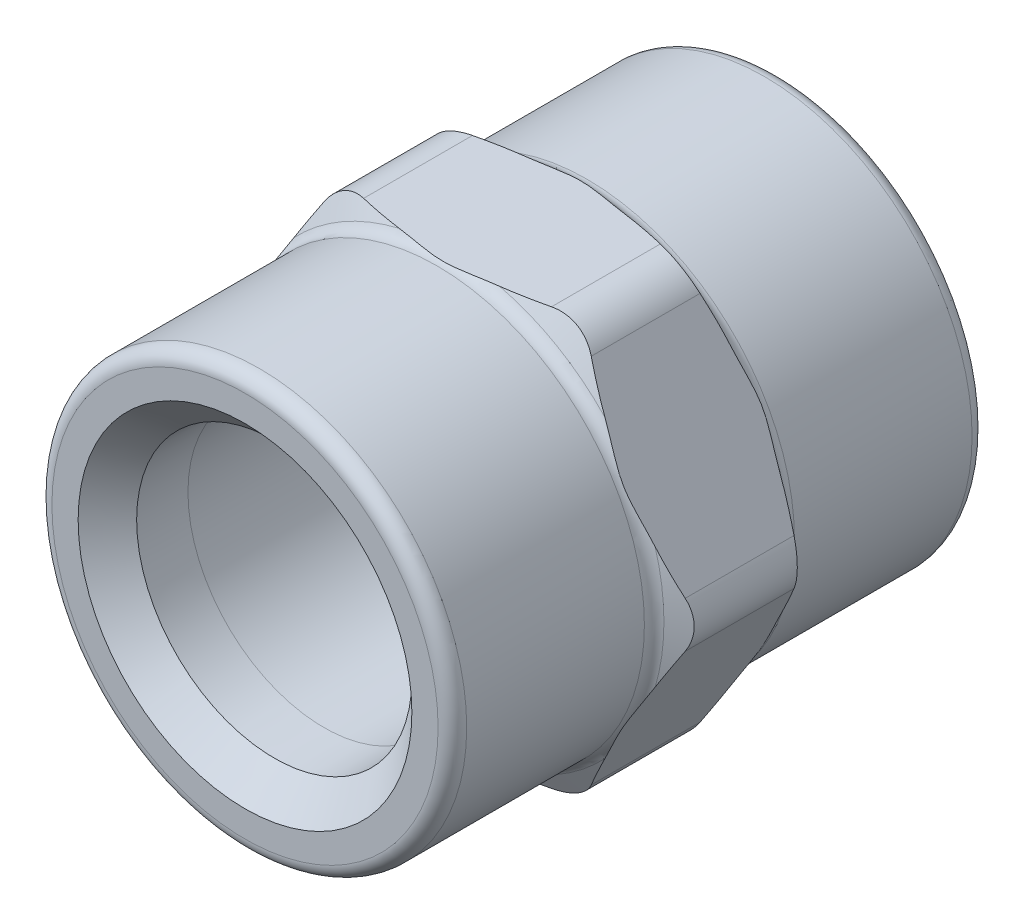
ISO-10303-21;
HEADER;
FILE_DESCRIPTION(('STEP AP214'),'2;1');
FILE_NAME('part.step','',(''),(''),'','','');
FILE_SCHEMA(('AUTOMOTIVE_DESIGN { 1 0 10303 214 1 1 1 1 }'));
ENDSEC;
DATA;
#1=APPLICATION_CONTEXT('core data for automotive mechanical design processes');
#2=APPLICATION_PROTOCOL_DEFINITION('international standard','automotive_design',2000,#1);
#3=PRODUCT_CONTEXT('',#1,'mechanical');
#4=PRODUCT('Part','Part','',(#3));
#5=PRODUCT_RELATED_PRODUCT_CATEGORY('part','',(#4));
#6=PRODUCT_DEFINITION_FORMATION('','',#4);
#7=PRODUCT_DEFINITION_CONTEXT('part definition',#1,'design');
#8=PRODUCT_DEFINITION('design','',#6,#7);
#9=PRODUCT_DEFINITION_SHAPE('','',#8);
#10=(LENGTH_UNIT() NAMED_UNIT(*) SI_UNIT(.MILLI.,.METRE.));
#11=(NAMED_UNIT(*) PLANE_ANGLE_UNIT() SI_UNIT($,.RADIAN.));
#12=(NAMED_UNIT(*) SI_UNIT($,.STERADIAN.) SOLID_ANGLE_UNIT());
#13=UNCERTAINTY_MEASURE_WITH_UNIT(LENGTH_MEASURE(1.E-05),#10,'distance_accuracy_value','');
#14=(GEOMETRIC_REPRESENTATION_CONTEXT(3) GLOBAL_UNCERTAINTY_ASSIGNED_CONTEXT((#13)) GLOBAL_UNIT_ASSIGNED_CONTEXT((#10,
#11,#12)) REPRESENTATION_CONTEXT('',''));
#15=CARTESIAN_POINT('',(0.,0.,0.));
#16=DIRECTION('',(0.,0.,1.));
#17=DIRECTION('',(1.,0.,0.));
#18=AXIS2_PLACEMENT_3D('',#15,#16,#17);
#19=CARTESIAN_POINT('',(5.0043277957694,8.66775,17.238737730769));
#20=DIRECTION('',(0.,0.,-1.));
#21=DIRECTION('',(-1.,0.,0.));
#22=AXIS2_PLACEMENT_3D('',#19,#20,#21);
#23=CYLINDRICAL_SURFACE('',#22,2.44475);
#24=DIRECTION('',(0.,0.,1.));
#25=VECTOR('',#24,1.);
#26=CARTESIAN_POINT('',(5.0043277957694,11.1125,14.224));
#27=LINE('',#26,#25);
#28=CARTESIAN_POINT('',(5.00432779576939,11.1125,17.1227862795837));
#29=VERTEX_POINT('',#28);
#30=CARTESIAN_POINT('',(5.00432779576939,11.1125,11.3252137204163));
#31=VERTEX_POINT('',#30);
#32=EDGE_CURVE('E454',#29,#31,#27,.F.);
#33=ORIENTED_EDGE('',*,*,#32,.F.);
#34=CARTESIAN_POINT('',(7.12154340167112,9.8901250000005,17.1227862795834));
#35=CARTESIAN_POINT('',(7.09046865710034,9.94396246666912,17.1080471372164));
#36=CARTESIAN_POINT('',(7.05721060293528,9.99681071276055,17.0942769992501));
#37=CARTESIAN_POINT('',(6.98648819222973,10.1001448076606,17.0687617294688));
#38=CARTESIAN_POINT('',(6.94902289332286,10.1506301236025,17.0570170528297));
#39=CARTESIAN_POINT('',(6.87004887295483,10.2488442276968,17.0356432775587));
#40=CARTESIAN_POINT('',(6.82853897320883,10.2965722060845,17.0260147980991));
#41=CARTESIAN_POINT('',(6.74174607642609,10.3888540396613,17.0089537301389));
#42=CARTESIAN_POINT('',(6.6964634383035,10.4334081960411,17.0015209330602));
#43=CARTESIAN_POINT('',(6.5551764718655,10.5619118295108,16.9825922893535));
#44=CARTESIAN_POINT('',(6.45380246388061,10.6406159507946,16.9744849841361));
#45=CARTESIAN_POINT('',(6.23985568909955,10.7811991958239,16.9676274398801));
#46=CARTESIAN_POINT('',(6.12728962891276,10.8430883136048,16.968871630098));
#47=CARTESIAN_POINT('',(5.89692162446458,10.9471567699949,16.9805080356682));
#48=CARTESIAN_POINT('',(5.7792956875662,10.989750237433,16.9906927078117));
#49=CARTESIAN_POINT('',(5.5399283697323,11.056335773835,17.0196150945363));
#50=CARTESIAN_POINT('',(5.41818924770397,11.080337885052,17.038348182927));
#51=CARTESIAN_POINT('',(5.24748047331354,11.1008760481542,17.0701065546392));
#52=CARTESIAN_POINT('',(5.19870704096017,11.1052503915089,17.079805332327));
#53=CARTESIAN_POINT('',(5.10135844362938,11.1110580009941,17.1004034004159));
#54=CARTESIAN_POINT('',(5.0527830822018,11.1124981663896,17.1112998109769));
#55=CARTESIAN_POINT('',(5.00432779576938,11.1125,17.1227862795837));
#56=B_SPLINE_CURVE_WITH_KNOTS('',3,(#34,#35,#36,#37,#38,#39,#40,#41,#42,#43,#44,#45,#46,#47,#48,
#49,#50,#51,#52,#53,#54,#55),.UNSPECIFIED.,.F.,.F.,(4,2,2,2,2,2,2,2,2,2,4),(0.,
0.191610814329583,0.383264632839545,0.574974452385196,0.766666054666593,1.15038235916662,
1.53387009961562,1.90868425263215,2.28329580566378,2.43297797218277,2.58230777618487),.UNSPECIFIED.);
#57=CARTESIAN_POINT('',(7.12154340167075,9.89012500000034,17.1227862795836));
#58=VERTEX_POINT('',#57);
#59=EDGE_CURVE('E560',#58,#29,#56,.T.);
#60=ORIENTED_EDGE('',*,*,#59,.F.);
#61=DIRECTION('',(0.,0.,1.));
#62=VECTOR('',#61,1.);
#63=CARTESIAN_POINT('',(7.12154340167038,9.89012500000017,14.2240000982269));
#64=LINE('',#63,#62);
#65=CARTESIAN_POINT('',(7.12154340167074,9.89012500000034,11.3252137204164));
#66=VERTEX_POINT('',#65);
#67=EDGE_CURVE('E451',#66,#58,#64,.T.);
#68=ORIENTED_EDGE('',*,*,#67,.F.);
#69=CARTESIAN_POINT('',(5.00432779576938,11.1125,11.3252137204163));
#70=CARTESIAN_POINT('',(5.06648978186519,11.1125072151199,11.3399528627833));
#71=CARTESIAN_POINT('',(5.12888673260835,11.1101290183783,11.3537230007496));
#72=CARTESIAN_POINT('',(5.25373788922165,11.1005486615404,11.379238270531));
#73=CARTESIAN_POINT('',(5.31619210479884,11.0933454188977,11.3909829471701));
#74=CARTESIAN_POINT('',(5.44073502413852,11.0740589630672,11.4123567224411));
#75=CARTESIAN_POINT('',(5.50282361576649,11.0619743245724,11.4219852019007));
#76=CARTESIAN_POINT('',(5.62613847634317,11.032950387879,11.439046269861));
#77=CARTESIAN_POINT('',(5.68736482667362,11.0160115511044,11.4464790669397));
#78=CARTESIAN_POINT('',(5.869295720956,10.9579052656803,11.4654077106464));
#79=CARTESIAN_POINT('',(5.98814249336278,10.9094648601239,11.4735150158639));
#80=CARTESIAN_POINT('',(6.21686454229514,10.7944731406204,11.4803725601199));
#81=CARTESIAN_POINT('',(6.32674512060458,10.7279326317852,11.479128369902));
#82=CARTESIAN_POINT('',(6.53205504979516,10.580462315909,11.4674919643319));
#83=CARTESIAN_POINT('',(6.62775504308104,10.4998920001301,11.4573072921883));
#84=CARTESIAN_POINT('',(6.80510346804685,10.3258865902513,11.4283849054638));
#85=CARTESIAN_POINT('',(6.88675946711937,10.2324584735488,11.4096518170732));
#86=CARTESIAN_POINT('',(6.98990042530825,10.094889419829,11.377893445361));
#87=CARTESIAN_POINT('',(7.01807543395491,10.0548375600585,11.3681946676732));
#88=CARTESIAN_POINT('',(7.07177926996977,9.97343500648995,11.3475965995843));
#89=CARTESIAN_POINT('',(7.09731417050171,9.93208759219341,11.3367001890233));
#90=CARTESIAN_POINT('',(7.12154340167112,9.89012500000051,11.3252137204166));
#91=B_SPLINE_CURVE_WITH_KNOTS('',3,(#69,#70,#71,#72,#73,#74,#75,#76,#77,#78,#79,#80,#81,#82,#83,
#84,#85,#86,#87,#88,#89,#90),.UNSPECIFIED.,.F.,.F.,(4,2,2,2,2,2,2,2,2,2,4),(0.,
0.191610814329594,0.383264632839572,0.574974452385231,0.76666605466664,1.15038235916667,
1.5338700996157,1.90868425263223,2.28329580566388,2.43297797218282,2.58230777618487),.UNSPECIFIED.);
#92=EDGE_CURVE('E200',#31,#66,#91,.T.);
#93=ORIENTED_EDGE('',*,*,#92,.F.);
#94=EDGE_LOOP('',(#33,#60,#68,#93));
#95=FACE_BOUND('',#94,.T.);
#96=ADVANCED_FACE('F16',(#95),#23,.T.);
#97=CARTESIAN_POINT('',(10.0086555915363,0.,17.238737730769));
#98=DIRECTION('',(0.,0.,-1.));
#99=DIRECTION('',(-1.,0.,0.));
#100=AXIS2_PLACEMENT_3D('',#97,#98,#99);
#101=CYLINDRICAL_SURFACE('',#100,2.44475000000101);
#102=DIRECTION('',(0.,0.,1.));
#103=VECTOR('',#102,1.);
#104=CARTESIAN_POINT('',(12.1258711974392,1.22237499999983,14.2240000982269));
#105=LINE('',#104,#103);
#106=CARTESIAN_POINT('',(12.1258711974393,1.22237499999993,17.1227862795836));
#107=VERTEX_POINT('',#106);
#108=CARTESIAN_POINT('',(12.1258711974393,1.22237499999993,11.3252137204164));
#109=VERTEX_POINT('',#108);
#110=EDGE_CURVE('E448',#107,#109,#105,.F.);
#111=ORIENTED_EDGE('',*,*,#110,.F.);
#112=CARTESIAN_POINT('',(12.1258711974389,-1.22237500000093,17.1227862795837));
#113=CARTESIAN_POINT('',(12.156958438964,-1.1685447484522,17.1080471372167));
#114=CARTESIAN_POINT('',(12.1860973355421,-1.11331830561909,17.0942769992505));
#115=CARTESIAN_POINT('',(12.2402260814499,-1.00040385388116,17.0687617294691));
#116=CARTESIAN_POINT('',(12.2652149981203,-0.942715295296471,17.05701705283));
#117=CARTESIAN_POINT('',(12.310783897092,-0.82521473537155,17.0356432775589));
#118=CARTESIAN_POINT('',(12.331362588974,-0.765402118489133,17.0260147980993));
#119=CARTESIAN_POINT('',(12.367884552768,-0.644096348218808,17.0089537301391));
#120=CARTESIAN_POINT('',(12.3838282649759,-0.582603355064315,17.0015209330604));
#121=CARTESIAN_POINT('',(12.4244721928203,-0.395993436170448,16.9825922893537));
#122=CARTESIAN_POINT('',(12.4419449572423,-0.268848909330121,16.9744849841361));
#123=CARTESIAN_POINT('',(12.4567202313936,-0.0132739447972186,16.9676274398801));
#124=CARTESIAN_POINT('',(12.4540347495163,0.115155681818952,16.9688716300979));
#125=CARTESIAN_POINT('',(12.4289766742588,0.366694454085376,16.9805080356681));
#126=CARTESIAN_POINT('',(12.4070507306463,0.48985823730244,16.9906927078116));
#127=CARTESIAN_POINT('',(12.3450318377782,0.730449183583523,17.0196150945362));
#128=CARTESIAN_POINT('',(12.3049487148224,0.847879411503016,17.0383481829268));
#129=CARTESIAN_POINT('',(12.2373808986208,1.00598662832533,17.070106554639));
#130=CARTESIAN_POINT('',(12.2167824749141,1.0504128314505,17.0798053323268));
#131=CARTESIAN_POINT('',(12.1731377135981,1.13762299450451,17.1004034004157));
#132=CARTESIAN_POINT('',(12.1500972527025,1.18041057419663,17.1112998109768));
#133=CARTESIAN_POINT('',(12.1258711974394,1.22237500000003,17.1227862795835));
#134=B_SPLINE_CURVE_WITH_KNOTS('',3,(#112,#113,#114,#115,#116,#117,#118,#119,#120,#121,#122,
#123,#124,#125,#126,#127,#128,#129,#130,#131,#132,#133),.UNSPECIFIED.,.F.,.F.,(4,2,2,2,2,2,2,2,
2,2,4),(0.,0.191610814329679,0.383264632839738,0.574974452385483,0.766666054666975,
1.15038235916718,1.53387009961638,1.90868425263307,2.28329580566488,2.43297797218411,
2.58230777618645),.UNSPECIFIED.);
#135=CARTESIAN_POINT('',(12.1258711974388,-1.22237500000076,17.1227862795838));
#136=VERTEX_POINT('',#135);
#137=EDGE_CURVE('E602',#136,#107,#134,.T.);
#138=ORIENTED_EDGE('',*,*,#137,.F.);
#139=DIRECTION('',(0.,0.,1.));
#140=VECTOR('',#139,1.);
#141=CARTESIAN_POINT('',(12.1258711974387,-1.22237500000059,14.2239999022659));
#142=LINE('',#141,#140);
#143=CARTESIAN_POINT('',(12.1258708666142,-1.22237557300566,11.325213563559));
#144=VERTEX_POINT('',#143);
#145=EDGE_CURVE('E445',#144,#136,#142,.T.);
#146=ORIENTED_EDGE('',*,*,#145,.F.);
#147=CARTESIAN_POINT('',(12.1258711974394,1.22237500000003,11.3252137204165));
#148=CARTESIAN_POINT('',(12.1569584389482,1.16854474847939,11.3399528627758));
#149=CARTESIAN_POINT('',(12.1860973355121,1.11331830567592,11.3537230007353));
#150=CARTESIAN_POINT('',(12.2402260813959,1.00040385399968,11.3792382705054));
#151=CARTESIAN_POINT('',(12.2652149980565,0.942715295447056,11.39098294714));
#152=CARTESIAN_POINT('',(12.3107838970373,0.825214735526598,11.4123567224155));
#153=CARTESIAN_POINT('',(12.3313625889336,0.765402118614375,11.4219852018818));
#154=CARTESIAN_POINT('',(12.3678845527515,0.644096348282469,11.4390462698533));
#155=CARTESIAN_POINT('',(12.3838282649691,0.582603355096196,11.4464790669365));
#156=CARTESIAN_POINT('',(12.4244721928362,0.395993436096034,11.4654077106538));
#157=CARTESIAN_POINT('',(12.4419449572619,0.268848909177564,11.473515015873));
#158=CARTESIAN_POINT('',(12.4567202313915,0.0132739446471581,11.4803725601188));
#159=CARTESIAN_POINT('',(12.4540347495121,-0.115155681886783,11.4791283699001));
#160=CARTESIAN_POINT('',(12.4289766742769,-0.366694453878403,11.4674919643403));
#161=CARTESIAN_POINT('',(12.4070507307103,-0.489858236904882,11.457307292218));
#162=CARTESIAN_POINT('',(12.3450318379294,-0.730449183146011,11.4283849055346));
#163=CARTESIAN_POINT('',(12.3049487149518,-0.847879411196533,11.4096518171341));
#164=CARTESIAN_POINT('',(12.2373808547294,-1.00598673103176,11.377893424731));
#165=CARTESIAN_POINT('',(12.2167823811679,-1.05041303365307,11.3681946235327));
#166=CARTESIAN_POINT('',(12.1731375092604,-1.13762338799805,11.3475965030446));
#167=CARTESIAN_POINT('',(12.1500969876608,-1.18041105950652,11.336700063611));
#168=CARTESIAN_POINT('',(12.1258708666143,-1.22237557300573,11.3252135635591));
#169=B_SPLINE_CURVE_WITH_KNOTS('',3,(#147,#148,#149,#150,#151,#152,#153,#154,#155,#156,#157,
#158,#159,#160,#161,#162,#163,#164,#165,#166,#167,#168),.UNSPECIFIED.,.F.,.F.,(4,2,2,2,2,2,2,2,
2,2,4),(0.,0.191610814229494,0.3832646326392,0.57497445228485,0.766666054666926,
1.15038235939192,1.53387009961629,1.90868425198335,2.28329580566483,2.43297831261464,
2.58230845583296),.UNSPECIFIED.);
#170=EDGE_CURVE('E281',#109,#144,#169,.T.);
#171=ORIENTED_EDGE('',*,*,#170,.F.);
#172=EDGE_LOOP('',(#111,#138,#146,#171));
#173=FACE_BOUND('',#172,.T.);
#174=ADVANCED_FACE('F606',(#173),#101,.T.);
#175=CARTESIAN_POINT('',(5.0043277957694,-8.66775,17.238737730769));
#176=DIRECTION('',(0.,0.,-1.));
#177=DIRECTION('',(-1.,0.,0.));
#178=AXIS2_PLACEMENT_3D('',#175,#176,#177);
#179=CYLINDRICAL_SURFACE('',#178,2.44474999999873);
#180=DIRECTION('',(0.,0.,1.));
#181=VECTOR('',#180,1.);
#182=CARTESIAN_POINT('',(7.12154340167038,-9.89012500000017,14.2239999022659));
#183=LINE('',#182,#181);
#184=CARTESIAN_POINT('',(7.12154340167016,-9.890125,17.1227862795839));
#185=VERTEX_POINT('',#184);
#186=CARTESIAN_POINT('',(7.12154340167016,-9.890125,11.3252137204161));
#187=VERTEX_POINT('',#186);
#188=EDGE_CURVE('E442',#185,#187,#183,.F.);
#189=ORIENTED_EDGE('',*,*,#188,.F.);
#190=CARTESIAN_POINT('',(5.00432779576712,-11.1124999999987,17.1227862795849));
#191=CARTESIAN_POINT('',(5.0664897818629,-11.1125072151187,17.1080471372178));
#192=CARTESIAN_POINT('',(5.12888673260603,-11.1101290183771,17.0942769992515));
#193=CARTESIAN_POINT('',(5.25373788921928,-11.1005486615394,17.0687617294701));
#194=CARTESIAN_POINT('',(5.31619210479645,-11.0933454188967,17.057017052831));
#195=CARTESIAN_POINT('',(5.44073502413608,-11.0740589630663,17.0356432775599));
#196=CARTESIAN_POINT('',(5.50282361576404,-11.0619743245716,17.0260147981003));
#197=CARTESIAN_POINT('',(5.62613847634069,-11.0329503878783,17.00895373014));
#198=CARTESIAN_POINT('',(5.68736482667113,-11.0160115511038,17.0015209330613));
#199=CARTESIAN_POINT('',(5.86929572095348,-10.9579052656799,16.9825922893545));
#200=CARTESIAN_POINT('',(5.98814249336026,-10.9094648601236,16.974484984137));
#201=CARTESIAN_POINT('',(6.21686454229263,-10.7944731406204,16.9676274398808));
#202=CARTESIAN_POINT('',(6.32674512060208,-10.7279326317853,16.9688716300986));
#203=CARTESIAN_POINT('',(6.5320550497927,-10.5804623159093,16.9805080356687));
#204=CARTESIAN_POINT('',(6.62775504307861,-10.4998920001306,16.9906927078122));
#205=CARTESIAN_POINT('',(6.80510346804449,-10.325886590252,17.0196150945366));
#206=CARTESIAN_POINT('',(6.88675946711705,-10.2324584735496,17.0383481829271));
#207=CARTESIAN_POINT('',(6.9899004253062,-10.0948894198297,17.0701065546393));
#208=CARTESIAN_POINT('',(7.01807543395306,-10.054837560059,17.0798053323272));
#209=CARTESIAN_POINT('',(7.07177926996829,-9.97343500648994,17.1004034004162));
#210=CARTESIAN_POINT('',(7.09731417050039,-9.93208759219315,17.1112998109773));
#211=CARTESIAN_POINT('',(7.12154340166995,-9.890125,17.122786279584));
#212=B_SPLINE_CURVE_WITH_KNOTS('',3,(#190,#191,#192,#193,#194,#195,#196,#197,#198,#199,#200,
#201,#202,#203,#204,#205,#206,#207,#208,#209,#210,#211),.UNSPECIFIED.,.F.,.F.,(4,2,2,2,2,2,2,2,
2,2,4),(0.,0.191610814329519,0.383264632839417,0.574974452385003,0.766666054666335,
1.15038235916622,1.5338700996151,1.90868425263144,2.2832958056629,2.43297797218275,
2.58230777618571),.UNSPECIFIED.);
#213=CARTESIAN_POINT('',(5.00432779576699,-11.1124999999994,17.1227862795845));
#214=VERTEX_POINT('',#213);
#215=EDGE_CURVE('E327',#214,#185,#212,.T.);
#216=ORIENTED_EDGE('',*,*,#215,.F.);
#217=DIRECTION('',(0.,0.,1.));
#218=VECTOR('',#217,1.);
#219=CARTESIAN_POINT('',(5.00432779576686,-11.1125,14.224000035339));
#220=LINE('',#219,#218);
#221=CARTESIAN_POINT('',(5.00432779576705,-11.1124999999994,11.3252137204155));
#222=VERTEX_POINT('',#221);
#223=EDGE_CURVE('E433',#214,#222,#220,.F.);
#224=ORIENTED_EDGE('',*,*,#223,.T.);
#225=CARTESIAN_POINT('',(7.12154340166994,-9.890125,11.325213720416));
#226=CARTESIAN_POINT('',(7.09046865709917,-9.94396246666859,11.3399528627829));
#227=CARTESIAN_POINT('',(7.05721060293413,-9.99681071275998,11.3537230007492));
#228=CARTESIAN_POINT('',(6.98648819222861,-10.10014480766,11.3792382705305));
#229=CARTESIAN_POINT('',(6.94902289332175,-10.1506301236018,11.3909829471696));
#230=CARTESIAN_POINT('',(6.87004887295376,-10.2488442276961,11.4123567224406));
#231=CARTESIAN_POINT('',(6.82853897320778,-10.2965722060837,11.4219852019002));
#232=CARTESIAN_POINT('',(6.74174607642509,-10.3888540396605,11.4390462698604));
#233=CARTESIAN_POINT('',(6.69646343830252,-10.4334081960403,11.4464790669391));
#234=CARTESIAN_POINT('',(6.55517647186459,-10.5619118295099,11.4654077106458));
#235=CARTESIAN_POINT('',(6.45380246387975,-10.6406159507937,11.4735150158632));
#236=CARTESIAN_POINT('',(6.2398556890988,-10.7811991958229,11.4803725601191));
#237=CARTESIAN_POINT('',(6.12728962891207,-10.8430883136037,11.4791283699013));
#238=CARTESIAN_POINT('',(5.89692162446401,-10.9471567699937,11.4674919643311));
#239=CARTESIAN_POINT('',(5.7792956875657,-10.9897502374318,11.4573072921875));
#240=CARTESIAN_POINT('',(5.53992836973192,-11.0563357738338,11.428384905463));
#241=CARTESIAN_POINT('',(5.41818924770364,-11.0803378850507,11.4096518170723));
#242=CARTESIAN_POINT('',(5.24748047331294,-11.100876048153,11.37789344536));
#243=CARTESIAN_POINT('',(5.19870704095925,-11.1052503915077,11.3681946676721));
#244=CARTESIAN_POINT('',(5.10135844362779,-11.1110580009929,11.3475965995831));
#245=CARTESIAN_POINT('',(5.05278308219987,-11.1124981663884,11.3367001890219));
#246=CARTESIAN_POINT('',(5.00432779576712,-11.1124999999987,11.3252137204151));
#247=B_SPLINE_CURVE_WITH_KNOTS('',3,(#225,#226,#227,#228,#229,#230,#231,#232,#233,#234,#235,
#236,#237,#238,#239,#240,#241,#242,#243,#244,#245,#246),.UNSPECIFIED.,.F.,.F.,(4,2,2,2,2,2,2,2,
2,2,4),(0.,0.19161081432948,0.383264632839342,0.574974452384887,0.766666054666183,
1.15038235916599,1.53387009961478,1.9086842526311,2.28329580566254,2.43297797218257,
2.5823077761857),.UNSPECIFIED.);
#248=EDGE_CURVE('E616',#187,#222,#247,.T.);
#249=ORIENTED_EDGE('',*,*,#248,.F.);
#250=EDGE_LOOP('',(#189,#216,#224,#249));
#251=FACE_BOUND('',#250,.T.);
#252=ADVANCED_FACE('F609',(#251),#179,.T.);
#253=CARTESIAN_POINT('',(-5.0043277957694,-8.66775,17.238737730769));
#254=DIRECTION('',(0.,0.,-1.));
#255=DIRECTION('',(-1.,0.,0.));
#256=AXIS2_PLACEMENT_3D('',#253,#254,#255);
#257=CYLINDRICAL_SURFACE('',#256,2.44475);
#258=DIRECTION('',(0.,0.,1.));
#259=VECTOR('',#258,1.);
#260=CARTESIAN_POINT('',(-5.0043277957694,-11.1125,14.224000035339));
#261=LINE('',#260,#259);
#262=CARTESIAN_POINT('',(-5.00432779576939,-11.1125,11.3252137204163));
#263=VERTEX_POINT('',#262);
#264=CARTESIAN_POINT('',(-5.00432779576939,-11.1125,17.1227862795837));
#265=VERTEX_POINT('',#264);
#266=EDGE_CURVE('E438',#263,#265,#261,.T.);
#267=ORIENTED_EDGE('',*,*,#266,.T.);
#268=CARTESIAN_POINT('',(-7.12154340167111,-9.89012500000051,17.1227862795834));
#269=CARTESIAN_POINT('',(-7.09046865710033,-9.94396246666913,17.1080471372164));
#270=CARTESIAN_POINT('',(-7.05721060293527,-9.99681071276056,17.0942769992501));
#271=CARTESIAN_POINT('',(-6.98648819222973,-10.1001448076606,17.0687617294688));
#272=CARTESIAN_POINT('',(-6.94902289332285,-10.1506301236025,17.0570170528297));
#273=CARTESIAN_POINT('',(-6.87004887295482,-10.2488442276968,17.0356432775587));
#274=CARTESIAN_POINT('',(-6.82853897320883,-10.2965722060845,17.0260147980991));
#275=CARTESIAN_POINT('',(-6.74174607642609,-10.3888540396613,17.0089537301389));
#276=CARTESIAN_POINT('',(-6.6964634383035,-10.4334081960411,17.0015209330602));
#277=CARTESIAN_POINT('',(-6.5551764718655,-10.5619118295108,16.9825922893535));
#278=CARTESIAN_POINT('',(-6.45380246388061,-10.6406159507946,16.9744849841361));
#279=CARTESIAN_POINT('',(-6.23985568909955,-10.7811991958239,16.9676274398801));
#280=CARTESIAN_POINT('',(-6.12728962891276,-10.8430883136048,16.968871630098));
#281=CARTESIAN_POINT('',(-5.89692162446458,-10.9471567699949,16.9805080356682));
#282=CARTESIAN_POINT('',(-5.7792956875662,-10.989750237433,16.9906927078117));
#283=CARTESIAN_POINT('',(-5.5399283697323,-11.056335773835,17.0196150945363));
#284=CARTESIAN_POINT('',(-5.41818924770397,-11.080337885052,17.038348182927));
#285=CARTESIAN_POINT('',(-5.24748047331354,-11.1008760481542,17.0701065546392));
#286=CARTESIAN_POINT('',(-5.19870704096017,-11.1052503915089,17.079805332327));
#287=CARTESIAN_POINT('',(-5.10135844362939,-11.1110580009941,17.1004034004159));
#288=CARTESIAN_POINT('',(-5.0527830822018,-11.1124981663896,17.1112998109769));
#289=CARTESIAN_POINT('',(-5.00432779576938,-11.1125,17.1227862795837));
#290=B_SPLINE_CURVE_WITH_KNOTS('',3,(#268,#269,#270,#271,#272,#273,#274,#275,#276,#277,#278,
#279,#280,#281,#282,#283,#284,#285,#286,#287,#288,#289),.UNSPECIFIED.,.F.,.F.,(4,2,2,2,2,2,2,2,
2,2,4),(0.,0.191610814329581,0.383264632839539,0.574974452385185,0.766666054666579,
1.1503823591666,1.53387009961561,1.90868425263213,2.28329580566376,2.43297797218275,
2.58230777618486),.UNSPECIFIED.);
#291=CARTESIAN_POINT('',(-7.12154340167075,-9.89012500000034,17.1227862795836));
#292=VERTEX_POINT('',#291);
#293=EDGE_CURVE('E436',#292,#265,#290,.T.);
#294=ORIENTED_EDGE('',*,*,#293,.F.);
#295=DIRECTION('',(0.,0.,1.));
#296=VECTOR('',#295,1.);
#297=CARTESIAN_POINT('',(-7.12154340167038,-9.89012500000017,14.2240000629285));
#298=LINE('',#297,#296);
#299=CARTESIAN_POINT('',(-7.12154340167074,-9.89012500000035,11.3252137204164));
#300=VERTEX_POINT('',#299);
#301=EDGE_CURVE('E425',#292,#300,#298,.F.);
#302=ORIENTED_EDGE('',*,*,#301,.T.);
#303=CARTESIAN_POINT('',(-5.00432779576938,-11.1125,11.3252137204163));
#304=CARTESIAN_POINT('',(-5.06648978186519,-11.1125072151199,11.3399528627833));
#305=CARTESIAN_POINT('',(-5.12888673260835,-11.1101290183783,11.3537230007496));
#306=CARTESIAN_POINT('',(-5.25373788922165,-11.1005486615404,11.379238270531));
#307=CARTESIAN_POINT('',(-5.31619210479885,-11.0933454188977,11.3909829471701));
#308=CARTESIAN_POINT('',(-5.44073502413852,-11.0740589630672,11.4123567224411));
#309=CARTESIAN_POINT('',(-5.50282361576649,-11.0619743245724,11.4219852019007));
#310=CARTESIAN_POINT('',(-5.62613847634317,-11.032950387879,11.439046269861));
#311=CARTESIAN_POINT('',(-5.68736482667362,-11.0160115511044,11.4464790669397));
#312=CARTESIAN_POINT('',(-5.869295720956,-10.9579052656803,11.4654077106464));
#313=CARTESIAN_POINT('',(-5.98814249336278,-10.9094648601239,11.4735150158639));
#314=CARTESIAN_POINT('',(-6.21686454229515,-10.7944731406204,11.4803725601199));
#315=CARTESIAN_POINT('',(-6.32674512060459,-10.7279326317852,11.479128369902));
#316=CARTESIAN_POINT('',(-6.53205504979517,-10.580462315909,11.4674919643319));
#317=CARTESIAN_POINT('',(-6.62775504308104,-10.4998920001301,11.4573072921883));
#318=CARTESIAN_POINT('',(-6.80510346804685,-10.3258865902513,11.4283849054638));
#319=CARTESIAN_POINT('',(-6.88675946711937,-10.2324584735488,11.4096518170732));
#320=CARTESIAN_POINT('',(-6.98990042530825,-10.094889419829,11.377893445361));
#321=CARTESIAN_POINT('',(-7.01807543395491,-10.0548375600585,11.3681946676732));
#322=CARTESIAN_POINT('',(-7.07177926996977,-9.97343500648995,11.3475965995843));
#323=CARTESIAN_POINT('',(-7.0973141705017,-9.93208759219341,11.3367001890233));
#324=CARTESIAN_POINT('',(-7.12154340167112,-9.89012500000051,11.3252137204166));
#325=B_SPLINE_CURVE_WITH_KNOTS('',3,(#303,#304,#305,#306,#307,#308,#309,#310,#311,#312,#313,
#314,#315,#316,#317,#318,#319,#320,#321,#322,#323,#324),.UNSPECIFIED.,.F.,.F.,(4,2,2,2,2,2,2,2,
2,2,4),(0.,0.191610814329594,0.383264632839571,0.574974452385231,0.766666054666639,
1.15038235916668,1.5338700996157,1.90868425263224,2.28329580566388,2.43297797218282,
2.58230777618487),.UNSPECIFIED.);
#326=EDGE_CURVE('E621',#263,#300,#325,.T.);
#327=ORIENTED_EDGE('',*,*,#326,.F.);
#328=EDGE_LOOP('',(#267,#294,#302,#327));
#329=FACE_BOUND('',#328,.T.);
#330=ADVANCED_FACE('F270',(#329),#257,.T.);
#331=CARTESIAN_POINT('',(-5.0043277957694,8.66775,17.238737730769));
#332=DIRECTION('',(0.,0.,-1.));
#333=DIRECTION('',(-1.,0.,0.));
#334=AXIS2_PLACEMENT_3D('',#331,#332,#333);
#335=CYLINDRICAL_SURFACE('',#334,2.44474999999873);
#336=DIRECTION('',(0.,0.,1.));
#337=VECTOR('',#336,1.);
#338=CARTESIAN_POINT('',(-7.12154340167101,9.89012499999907,14.224));
#339=LINE('',#338,#337);
#340=CARTESIAN_POINT('',(-7.12154340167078,9.89012499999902,11.3252137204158));
#341=VERTEX_POINT('',#340);
#342=CARTESIAN_POINT('',(-7.12154340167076,9.89012499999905,17.1227862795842));
#343=VERTEX_POINT('',#342);
#344=EDGE_CURVE('E194',#341,#343,#339,.T.);
#345=ORIENTED_EDGE('',*,*,#344,.T.);
#346=CARTESIAN_POINT('',(-5.00432779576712,11.1124999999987,17.1227862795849));
#347=CARTESIAN_POINT('',(-5.0664897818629,11.1125072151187,17.1080471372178));
#348=CARTESIAN_POINT('',(-5.12888673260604,11.1101290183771,17.0942769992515));
#349=CARTESIAN_POINT('',(-5.25373788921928,11.1005486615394,17.0687617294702));
#350=CARTESIAN_POINT('',(-5.31619210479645,11.0933454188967,17.057017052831));
#351=CARTESIAN_POINT('',(-5.44073502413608,11.0740589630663,17.0356432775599));
#352=CARTESIAN_POINT('',(-5.50282361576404,11.0619743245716,17.0260147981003));
#353=CARTESIAN_POINT('',(-5.62613847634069,11.0329503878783,17.00895373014));
#354=CARTESIAN_POINT('',(-5.68736482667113,11.0160115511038,17.0015209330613));
#355=CARTESIAN_POINT('',(-5.86929572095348,10.9579052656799,16.9825922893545));
#356=CARTESIAN_POINT('',(-5.98814249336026,10.9094648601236,16.974484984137));
#357=CARTESIAN_POINT('',(-6.21686454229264,10.7944731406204,16.9676274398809));
#358=CARTESIAN_POINT('',(-6.32674512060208,10.7279326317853,16.9688716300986));
#359=CARTESIAN_POINT('',(-6.5320550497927,10.5804623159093,16.9805080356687));
#360=CARTESIAN_POINT('',(-6.62775504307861,10.4998920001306,16.9906927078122));
#361=CARTESIAN_POINT('',(-6.80510346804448,10.325886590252,17.0196150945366));
#362=CARTESIAN_POINT('',(-6.88675946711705,10.2324584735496,17.0383481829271));
#363=CARTESIAN_POINT('',(-6.98990042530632,10.0948894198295,17.0701065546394));
#364=CARTESIAN_POINT('',(-7.01807543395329,10.0548375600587,17.0798053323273));
#365=CARTESIAN_POINT('',(-7.07177926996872,9.97343500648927,17.1004034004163));
#366=CARTESIAN_POINT('',(-7.09731417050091,9.9320875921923,17.1112998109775));
#367=CARTESIAN_POINT('',(-7.12154340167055,9.89012499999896,17.1227862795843));
#368=B_SPLINE_CURVE_WITH_KNOTS('',3,(#346,#347,#348,#349,#350,#351,#352,#353,#354,#355,#356,
#357,#358,#359,#360,#361,#362,#363,#364,#365,#366,#367),.UNSPECIFIED.,.F.,.F.,(4,2,2,2,2,2,2,2,
2,2,4),(0.,0.191610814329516,0.383264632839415,0.574974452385,0.766666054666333,
1.15038235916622,1.53387009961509,1.90868425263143,2.28329580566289,2.43297797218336,
2.58230777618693),.UNSPECIFIED.);
#369=CARTESIAN_POINT('',(-5.00432779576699,11.1124999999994,17.1227862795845));
#370=VERTEX_POINT('',#369);
#371=EDGE_CURVE('E275',#370,#343,#368,.T.);
#372=ORIENTED_EDGE('',*,*,#371,.F.);
#373=DIRECTION('',(0.,0.,1.));
#374=VECTOR('',#373,1.);
#375=CARTESIAN_POINT('',(-5.00432779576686,11.1125,14.224));
#376=LINE('',#375,#374);
#377=CARTESIAN_POINT('',(-5.00432779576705,11.1124999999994,11.3252137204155));
#378=VERTEX_POINT('',#377);
#379=EDGE_CURVE('E195',#378,#370,#376,.T.);
#380=ORIENTED_EDGE('',*,*,#379,.F.);
#381=CARTESIAN_POINT('',(-7.12154340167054,9.89012499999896,11.3252137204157));
#382=CARTESIAN_POINT('',(-7.0904686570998,9.94396246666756,11.3399528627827));
#383=CARTESIAN_POINT('',(-7.05721060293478,9.99681071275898,11.3537230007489));
#384=CARTESIAN_POINT('',(-6.98648819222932,10.100144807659,11.3792382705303));
#385=CARTESIAN_POINT('',(-6.94902289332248,10.1506301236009,11.3909829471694));
#386=CARTESIAN_POINT('',(-6.87004887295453,10.2488442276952,11.4123567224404));
#387=CARTESIAN_POINT('',(-6.82853897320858,10.2965722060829,11.4219852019));
#388=CARTESIAN_POINT('',(-6.74174607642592,10.3888540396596,11.4390462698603));
#389=CARTESIAN_POINT('',(-6.69646343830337,10.4334081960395,11.4464790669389));
#390=CARTESIAN_POINT('',(-6.55517647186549,10.5619118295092,11.4654077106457));
#391=CARTESIAN_POINT('',(-6.45380246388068,10.640615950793,11.4735150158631));
#392=CARTESIAN_POINT('',(-6.23985568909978,10.7811991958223,11.4803725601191));
#393=CARTESIAN_POINT('',(-6.12728962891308,10.8430883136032,11.4791283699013));
#394=CARTESIAN_POINT('',(-5.89692162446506,10.9471567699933,11.4674919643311));
#395=CARTESIAN_POINT('',(-5.77929568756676,10.9897502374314,11.4573072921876));
#396=CARTESIAN_POINT('',(-5.539928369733,11.0563357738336,11.4283849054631));
#397=CARTESIAN_POINT('',(-5.41818924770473,11.0803378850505,11.4096518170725));
#398=CARTESIAN_POINT('',(-5.24748047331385,11.1008760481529,11.3778934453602));
#399=CARTESIAN_POINT('',(-5.19870704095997,11.1052503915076,11.3681946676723));
#400=CARTESIAN_POINT('',(-5.10135844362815,11.1110580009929,11.3475965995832));
#401=CARTESIAN_POINT('',(-5.05278308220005,11.1124981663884,11.336700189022));
#402=CARTESIAN_POINT('',(-5.00432779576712,11.1124999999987,11.3252137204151));
#403=B_SPLINE_CURVE_WITH_KNOTS('',3,(#381,#382,#383,#384,#385,#386,#387,#388,#389,#390,#391,
#392,#393,#394,#395,#396,#397,#398,#399,#400,#401,#402),.UNSPECIFIED.,.F.,.F.,(4,2,2,2,2,2,2,2,
2,2,4),(0.,0.191610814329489,0.383264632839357,0.574974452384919,0.766666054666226,
1.15038235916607,1.5338700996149,1.90868425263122,2.28329580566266,2.43297797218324,
2.58230777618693),.UNSPECIFIED.);
#404=EDGE_CURVE('E190',#341,#378,#403,.T.);
#405=ORIENTED_EDGE('',*,*,#404,.F.);
#406=EDGE_LOOP('',(#345,#372,#380,#405));
#407=FACE_BOUND('',#406,.T.);
#408=ADVANCED_FACE('F192',(#407),#335,.T.);
#409=CARTESIAN_POINT('',(-10.0086555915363,0.,17.238737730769));
#410=DIRECTION('',(0.,0.,-1.));
#411=DIRECTION('',(-1.,0.,0.));
#412=AXIS2_PLACEMENT_3D('',#409,#410,#411);
#413=CYLINDRICAL_SURFACE('',#412,2.44475000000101);
#414=DIRECTION('',(0.,0.,1.));
#415=VECTOR('',#414,1.);
#416=CARTESIAN_POINT('',(-12.1258711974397,-1.22237499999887,14.2240000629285));
#417=LINE('',#416,#415);
#418=CARTESIAN_POINT('',(-12.1258711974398,-1.222374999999,11.3252137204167));
#419=VERTEX_POINT('',#418);
#420=CARTESIAN_POINT('',(-12.1258708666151,-1.22237557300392,17.1227864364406));
#421=VERTEX_POINT('',#420);
#422=EDGE_CURVE('E430',#419,#421,#417,.T.);
#423=ORIENTED_EDGE('',*,*,#422,.T.);
#424=CARTESIAN_POINT('',(-12.1258711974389,1.22237500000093,17.1227862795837));
#425=CARTESIAN_POINT('',(-12.1569584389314,1.16854474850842,17.1080471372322));
#426=CARTESIAN_POINT('',(-12.1860973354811,1.1133183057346,17.0942769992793));
#427=CARTESIAN_POINT('',(-12.240226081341,1.0004038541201,17.0687617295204));
#428=CARTESIAN_POINT('',(-12.2652149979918,0.942715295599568,17.0570170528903));
#429=CARTESIAN_POINT('',(-12.3107838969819,0.825214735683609,17.0356432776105));
#430=CARTESIAN_POINT('',(-12.3313625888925,0.765402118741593,17.0260147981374));
#431=CARTESIAN_POINT('',(-12.3678845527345,0.644096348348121,17.0089537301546));
#432=CARTESIAN_POINT('',(-12.3838282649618,0.582603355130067,17.0015209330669));
#433=CARTESIAN_POINT('',(-12.4244721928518,0.395993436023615,16.982592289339));
#434=CARTESIAN_POINT('',(-12.4419449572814,0.26884890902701,16.974484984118));
#435=CARTESIAN_POINT('',(-12.4567202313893,0.0132739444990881,16.9676274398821));
#436=CARTESIAN_POINT('',(-12.454034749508,-0.115155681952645,16.9688716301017));
#437=CARTESIAN_POINT('',(-12.4289766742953,-0.366694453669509,16.9805080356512));
#438=CARTESIAN_POINT('',(-12.4070507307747,-0.489858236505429,16.9906927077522));
#439=CARTESIAN_POINT('',(-12.3450318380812,-0.730449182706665,17.0196150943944));
#440=CARTESIAN_POINT('',(-12.3049487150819,-0.84787941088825,17.0383481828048));
#441=CARTESIAN_POINT('',(-12.2373808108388,-1.00598683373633,17.0701065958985));
#442=CARTESIAN_POINT('',(-12.2167822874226,-1.05041323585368,17.0798054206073));
#443=CARTESIAN_POINT('',(-12.1731373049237,-1.13762378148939,17.1004035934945));
#444=CARTESIAN_POINT('',(-12.1500967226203,-1.18041154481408,17.1113000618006));
#445=CARTESIAN_POINT('',(-12.1258705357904,-1.22237614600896,17.1227865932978));
#446=B_SPLINE_CURVE_WITH_KNOTS('',3,(#424,#425,#426,#427,#428,#429,#430,#431,#432,#433,#434,
#435,#436,#437,#438,#439,#440,#441,#442,#443,#444,#445),.UNSPECIFIED.,.F.,.F.,(4,2,2,2,2,2,2,2,
2,2,4),(0.,0.19161081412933,0.383264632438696,0.574974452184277,0.766666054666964,
1.15038235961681,1.53387009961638,1.90868425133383,2.28329580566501,2.43297865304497,
2.58230913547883),.UNSPECIFIED.);
#447=CARTESIAN_POINT('',(-12.1258711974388,1.22237500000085,17.1227862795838));
#448=VERTEX_POINT('',#447);
#449=EDGE_CURVE('E217',#448,#421,#446,.T.);
#450=ORIENTED_EDGE('',*,*,#449,.F.);
#451=DIRECTION('',(0.,0.,1.));
#452=VECTOR('',#451,1.);
#453=CARTESIAN_POINT('',(-12.1258711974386,1.22237500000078,14.224));
#454=LINE('',#453,#452);
#455=CARTESIAN_POINT('',(-12.1258711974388,1.22237500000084,11.3252137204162));
#456=VERTEX_POINT('',#455);
#457=EDGE_CURVE('E421',#448,#456,#454,.F.);
#458=ORIENTED_EDGE('',*,*,#457,.T.);
#459=CARTESIAN_POINT('',(-12.1258711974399,-1.22237499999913,11.3252137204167));
#460=CARTESIAN_POINT('',(-12.156958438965,-1.16854474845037,11.3399528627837));
#461=CARTESIAN_POINT('',(-12.1860973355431,-1.11331830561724,11.35372300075));
#462=CARTESIAN_POINT('',(-12.2402260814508,-1.00040385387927,11.3792382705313));
#463=CARTESIAN_POINT('',(-12.2652149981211,-0.942715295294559,11.3909829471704));
#464=CARTESIAN_POINT('',(-12.3107838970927,-0.825214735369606,11.4123567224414));
#465=CARTESIAN_POINT('',(-12.3313625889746,-0.765402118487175,11.421985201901));
#466=CARTESIAN_POINT('',(-12.3678845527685,-0.644096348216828,11.4390462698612));
#467=CARTESIAN_POINT('',(-12.3838282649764,-0.582603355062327,11.4464790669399));
#468=CARTESIAN_POINT('',(-12.4244721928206,-0.395993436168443,11.4654077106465));
#469=CARTESIAN_POINT('',(-12.4419449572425,-0.268848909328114,11.473515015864));
#470=CARTESIAN_POINT('',(-12.4567202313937,-0.0132739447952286,11.4803725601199));
#471=CARTESIAN_POINT('',(-12.4540347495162,0.115155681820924,11.479128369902));
#472=CARTESIAN_POINT('',(-12.4289766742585,0.366694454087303,11.4674919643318));
#473=CARTESIAN_POINT('',(-12.4070507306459,0.489858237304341,11.4573072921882));
#474=CARTESIAN_POINT('',(-12.3450318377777,0.730449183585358,11.4283849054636));
#475=CARTESIAN_POINT('',(-12.3049487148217,0.847879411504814,11.4096518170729));
#476=CARTESIAN_POINT('',(-12.2373808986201,1.00598662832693,11.3778934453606));
#477=CARTESIAN_POINT('',(-12.2167824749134,1.05041283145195,11.3681946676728));
#478=CARTESIAN_POINT('',(-12.1731377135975,1.13762299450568,11.347596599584));
#479=CARTESIAN_POINT('',(-12.1500972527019,1.18041057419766,11.3367001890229));
#480=CARTESIAN_POINT('',(-12.1258711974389,1.22237500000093,11.3252137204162));
#481=B_SPLINE_CURVE_WITH_KNOTS('',3,(#459,#460,#461,#462,#463,#464,#465,#466,#467,#468,#469,
#470,#471,#472,#473,#474,#475,#476,#477,#478,#479,#480),.UNSPECIFIED.,.F.,.F.,(4,2,2,2,2,2,2,2,
2,2,4),(0.,0.191610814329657,0.383264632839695,0.574974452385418,0.766666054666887,
1.15038235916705,1.5338700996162,1.90868425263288,2.28329580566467,2.43297797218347,
2.58230777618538),.UNSPECIFIED.);
#482=EDGE_CURVE('E625',#419,#456,#481,.T.);
#483=ORIENTED_EDGE('',*,*,#482,.F.);
#484=EDGE_LOOP('',(#423,#450,#458,#483));
#485=FACE_BOUND('',#484,.T.);
#486=ADVANCED_FACE('F243',(#485),#413,.T.);
#487=CARTESIAN_POINT('',(0.,0.,11.4823825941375));
#488=DIRECTION('',(0.,0.,1.));
#489=DIRECTION('',(0.,-1.,0.));
#490=AXIS2_PLACEMENT_3D('',#487,#488,#489);
#491=CONICAL_SURFACE('',#490,12.4595520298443,1.0471975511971);
#492=CARTESIAN_POINT('',(-2.67530255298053,11.1125,10.8879704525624));
#493=CARTESIAN_POINT('',(-2.87114995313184,11.1125,10.9144313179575));
#494=CARTESIAN_POINT('',(-3.06662356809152,11.1125,10.9435984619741));
#495=CARTESIAN_POINT('',(-3.45662407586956,11.1125,11.0070155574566));
#496=CARTESIAN_POINT('',(-3.65115147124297,11.1125,11.0412624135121));
#497=CARTESIAN_POINT('',(-4.03928705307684,11.1125,11.1145399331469));
#498=CARTESIAN_POINT('',(-4.23289529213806,11.1125,11.1535703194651));
#499=CARTESIAN_POINT('',(-4.61927793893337,11.1125,11.2361140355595));
#500=CARTESIAN_POINT('',(-4.81205176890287,11.1125,11.2796300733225));
#501=CARTESIAN_POINT('',(-5.00432779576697,11.1125,11.3252137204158));
#502=B_SPLINE_CURVE_WITH_KNOTS('',3,(#492,#493,#494,#495,#496,#497,#498,#499,#500,#501),
.UNSPECIFIED.,.F.,.F.,(4,2,2,2,4),(0.,0.592850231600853,1.18534067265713,1.77779678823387,
2.37061268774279),.UNSPECIFIED.);
#503=CARTESIAN_POINT('',(-2.67530255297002,11.1124999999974,10.8879704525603));
#504=VERTEX_POINT('',#503);
#505=EDGE_CURVE('E250',#504,#378,#502,.T.);
#506=ORIENTED_EDGE('',*,*,#505,.F.);
#507=CARTESIAN_POINT('',(0.,0.,10.8879704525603));
#508=DIRECTION('',(0.,0.,-1.));
#509=DIRECTION('',(-0.999999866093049,-0.000517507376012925,0.));
#510=AXIS2_PLACEMENT_3D('',#507,#508,#509);
#511=CIRCLE('',#510,11.4299999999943);
#512=CARTESIAN_POINT('',(-8.28605600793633,7.87312999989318,10.8879704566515));
#513=VERTEX_POINT('',#512);
#514=EDGE_CURVE('E214',#504,#513,#511,.F.);
#515=ORIENTED_EDGE('',*,*,#514,.T.);
#516=CARTESIAN_POINT('',(-8.28605600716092,7.87312999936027,10.8879704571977));
#517=CARTESIAN_POINT('',(-8.18813230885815,8.04273882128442,10.9144313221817));
#518=CARTESIAN_POINT('',(-8.09039550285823,8.21202393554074,10.9435984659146));
#519=CARTESIAN_POINT('',(-7.89539525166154,8.54977427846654,11.0070155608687));
#520=CARTESIAN_POINT('',(-7.79813155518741,8.71823994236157,11.0412624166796));
#521=CARTESIAN_POINT('',(-7.60406376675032,9.05437521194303,11.1145399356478));
#522=CARTESIAN_POINT('',(-7.50725964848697,9.22204486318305,11.1535703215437));
#523=CARTESIAN_POINT('',(-7.31406832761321,9.55666204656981,11.2361140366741));
#524=CARTESIAN_POINT('',(-7.21768141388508,9.72360907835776,11.2796300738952));
#525=CARTESIAN_POINT('',(-7.12154340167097,9.89012499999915,11.3252137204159));
#526=B_SPLINE_CURVE_WITH_KNOTS('',3,(#516,#517,#518,#519,#520,#521,#522,#523,#524,#525),
.UNSPECIFIED.,.F.,.F.,(4,2,2,2,4),(0.,0.592850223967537,1.18534065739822,1.77779676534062,
2.37061265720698),.UNSPECIFIED.);
#527=EDGE_CURVE('E207',#513,#341,#526,.T.);
#528=ORIENTED_EDGE('',*,*,#527,.T.);
#529=ORIENTED_EDGE('',*,*,#404,.T.);
#530=EDGE_LOOP('',(#506,#515,#528,#529));
#531=FACE_BOUND('',#530,.T.);
#532=ADVANCED_FACE('F212',(#531),#491,.T.);
#533=CARTESIAN_POINT('',(0.,0.,11.4823825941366));
#534=DIRECTION('',(0.,0.,1.));
#535=DIRECTION('',(1.,0.,0.));
#536=AXIS2_PLACEMENT_3D('',#533,#534,#535);
#537=CONICAL_SURFACE('',#536,12.4595520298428,1.0471975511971);
#538=CARTESIAN_POINT('',(8.28605602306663,7.87312997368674,10.8879704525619));
#539=CARTESIAN_POINT('',(8.18813232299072,8.04273879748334,10.914431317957));
#540=CARTESIAN_POINT('',(8.09039551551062,8.21202391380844,10.9435984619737));
#541=CARTESIAN_POINT('',(7.89539526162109,8.54977426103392,11.0070155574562));
#542=CARTESIAN_POINT('',(7.79813156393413,8.71823992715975,11.0412624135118));
#543=CARTESIAN_POINT('',(7.60406377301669,9.0543752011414,11.1145399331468));
#544=CARTESIAN_POINT('',(7.50725965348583,9.22204485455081,11.1535703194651));
#545=CARTESIAN_POINT('',(7.31406833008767,9.55666204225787,11.2361140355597));
#546=CARTESIAN_POINT('',(7.21768141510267,9.72360907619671,11.2796300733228));
#547=CARTESIAN_POINT('',(7.12154340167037,9.89012500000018,11.3252137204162));
#548=B_SPLINE_CURVE_WITH_KNOTS('',3,(#538,#539,#540,#541,#542,#543,#544,#545,#546,#547),
.UNSPECIFIED.,.F.,.F.,(4,2,2,2,4),(0.,0.592850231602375,1.18534067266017,1.77779678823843,
2.37061268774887),.UNSPECIFIED.);
#549=CARTESIAN_POINT('',(8.2860560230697,7.87312997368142,10.8879704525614));
#550=VERTEX_POINT('',#549);
#551=EDGE_CURVE('E597',#550,#66,#548,.T.);
#552=ORIENTED_EDGE('',*,*,#551,.F.);
#553=CARTESIAN_POINT('',(0.,0.,10.887970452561));
#554=DIRECTION('',(0.,0.,-1.));
#555=DIRECTION('',(-0.999999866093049,-0.000517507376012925,0.));
#556=AXIS2_PLACEMENT_3D('',#553,#554,#555);
#557=CIRCLE('',#556,11.4299999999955);
#558=CARTESIAN_POINT('',(2.67530255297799,11.1125,10.8879704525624));
#559=VERTEX_POINT('',#558);
#560=EDGE_CURVE('E415',#550,#559,#557,.F.);
#561=ORIENTED_EDGE('',*,*,#560,.T.);
#562=CARTESIAN_POINT('',(5.00432779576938,11.1125,11.3252137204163));
#563=CARTESIAN_POINT('',(4.81205176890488,11.1125,11.279630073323));
#564=CARTESIAN_POINT('',(4.61927793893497,11.1125,11.2361140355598));
#565=CARTESIAN_POINT('',(4.23289529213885,11.1125,11.1535703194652));
#566=CARTESIAN_POINT('',(4.03928705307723,11.1125,11.114539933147));
#567=CARTESIAN_POINT('',(3.65115147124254,11.1125,11.041262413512));
#568=CARTESIAN_POINT('',(3.45662407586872,11.1125,11.0070155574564));
#569=CARTESIAN_POINT('',(3.06662356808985,11.1125,10.9435984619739));
#570=CARTESIAN_POINT('',(2.87114995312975,11.1125,10.9144313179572));
#571=CARTESIAN_POINT('',(2.67530255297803,11.1125,10.8879704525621));
#572=B_SPLINE_CURVE_WITH_KNOTS('',3,(#562,#563,#564,#565,#566,#567,#568,#569,#570,#571),
.UNSPECIFIED.,.F.,.F.,(4,2,2,2,4),(0.,0.592815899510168,1.18527201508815,1.77776245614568,
2.37061268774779),.UNSPECIFIED.);
#573=EDGE_CURVE('E456',#31,#559,#572,.T.);
#574=ORIENTED_EDGE('',*,*,#573,.F.);
#575=ORIENTED_EDGE('',*,*,#92,.T.);
#576=EDGE_LOOP('',(#552,#561,#574,#575));
#577=FACE_BOUND('',#576,.T.);
#578=ADVANCED_FACE('F242',(#577),#537,.T.);
#579=CARTESIAN_POINT('',(0.,0.,11.4823796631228));
#580=DIRECTION('',(0.,0.,1.));
#581=DIRECTION('',(0.,-1.,0.));
#582=AXIS2_PLACEMENT_3D('',#579,#580,#581);
#583=CONICAL_SURFACE('',#582,12.4595469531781,1.0471975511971);
#584=CARTESIAN_POINT('',(-12.1258711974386,1.22237500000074,11.3252137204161));
#585=CARTESIAN_POINT('',(-12.0297331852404,1.38889092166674,11.2796300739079));
#586=CARTESIAN_POINT('',(-11.933346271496,1.55583795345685,11.2361140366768));
#587=CARTESIAN_POINT('',(-11.7401549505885,1.89045513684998,11.1535703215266));
#588=CARTESIAN_POINT('',(-11.6433508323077,2.0581247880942,11.1145399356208));
#589=CARTESIAN_POINT('',(-11.4492830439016,2.39426005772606,11.0412624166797));
#590=CARTESIAN_POINT('',(-11.3520193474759,2.56272572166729,11.0070155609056));
#591=CARTESIAN_POINT('',(-11.1570190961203,2.90047606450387,10.9435984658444));
#592=CARTESIAN_POINT('',(-11.0592822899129,3.06976117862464,10.9144313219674));
#593=CARTESIAN_POINT('',(-10.9613585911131,3.23937000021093,10.887970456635));
#594=B_SPLINE_CURVE_WITH_KNOTS('',3,(#584,#585,#586,#587,#588,#589,#590,#591,#592,#593),
.UNSPECIFIED.,.F.,.F.,(4,2,2,2,4),(0.,0.592815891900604,1.185271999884,1.77776243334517,
2.37061265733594),.UNSPECIFIED.);
#595=CARTESIAN_POINT('',(-10.9613585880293,3.23936999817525,10.8879704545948));
#596=VERTEX_POINT('',#595);
#597=EDGE_CURVE('E215',#456,#596,#594,.T.);
#598=ORIENTED_EDGE('',*,*,#597,.T.);
#599=CARTESIAN_POINT('',(0.,0.,10.8879704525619));
#600=DIRECTION('',(0.,0.,-1.));
#601=DIRECTION('',(-0.999999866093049,-0.000517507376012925,0.));
#602=AXIS2_PLACEMENT_3D('',#599,#600,#601);
#603=CIRCLE('',#602,11.4299999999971);
#604=CARTESIAN_POINT('',(-10.9613585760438,-3.23937002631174,10.8879704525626));
#605=VERTEX_POINT('',#604);
#606=EDGE_CURVE('E411',#596,#605,#603,.F.);
#607=ORIENTED_EDGE('',*,*,#606,.T.);
#608=CARTESIAN_POINT('',(-10.9613585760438,-3.23937002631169,10.8879704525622));
#609=CARTESIAN_POINT('',(-11.0592822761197,-3.06976120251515,10.9144313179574));
#610=CARTESIAN_POINT('',(-11.1570190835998,-2.9004760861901,10.943598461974));
#611=CARTESIAN_POINT('',(-11.3520193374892,-2.56272573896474,11.0070155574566));
#612=CARTESIAN_POINT('',(-11.4492830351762,-2.39426007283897,11.0412624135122));
#613=CARTESIAN_POINT('',(-11.6433508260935,-2.05812479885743,11.1145399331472));
#614=CARTESIAN_POINT('',(-11.7401549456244,-1.89045514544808,11.1535703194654));
#615=CARTESIAN_POINT('',(-11.9333462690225,-1.55583795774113,11.23611403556));
#616=CARTESIAN_POINT('',(-12.0297331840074,-1.38889092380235,11.2796300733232));
#617=CARTESIAN_POINT('',(-12.1258711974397,-1.22237499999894,11.3252137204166));
#618=B_SPLINE_CURVE_WITH_KNOTS('',3,(#608,#609,#610,#611,#612,#613,#614,#615,#616,#617),
.UNSPECIFIED.,.F.,.F.,(4,2,2,2,4),(0.,0.592850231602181,1.18534067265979,1.77779678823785,
2.37061268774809),.UNSPECIFIED.);
#619=EDGE_CURVE('E432',#605,#419,#618,.T.);
#620=ORIENTED_EDGE('',*,*,#619,.T.);
#621=ORIENTED_EDGE('',*,*,#482,.T.);
#622=EDGE_LOOP('',(#598,#607,#620,#621));
#623=FACE_BOUND('',#622,.T.);
#624=ADVANCED_FACE('F632',(#623),#583,.T.);
#625=CARTESIAN_POINT('',(0.,0.,11.482382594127));
#626=DIRECTION('',(0.,0.,1.));
#627=DIRECTION('',(1.,0.,0.));
#628=AXIS2_PLACEMENT_3D('',#625,#626,#627);
#629=CONICAL_SURFACE('',#628,12.4595520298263,1.0471975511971);
#630=CARTESIAN_POINT('',(-7.12154340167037,-9.89012500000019,11.3252137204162));
#631=CARTESIAN_POINT('',(-7.21768141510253,-9.72360907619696,11.2796300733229));
#632=CARTESIAN_POINT('',(-7.31406833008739,-9.55666204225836,11.2361140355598));
#633=CARTESIAN_POINT('',(-7.50725965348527,-9.22204485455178,11.1535703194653));
#634=CARTESIAN_POINT('',(-7.60406377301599,-9.05437520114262,11.1145399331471));
#635=CARTESIAN_POINT('',(-7.79813156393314,-8.71823992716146,11.0412624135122));
#636=CARTESIAN_POINT('',(-7.89539526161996,-8.54977426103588,11.0070155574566));
#637=CARTESIAN_POINT('',(-8.09039551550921,-8.21202391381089,10.9435984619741));
#638=CARTESIAN_POINT('',(-8.18813232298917,-8.04273879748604,10.9144313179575));
#639=CARTESIAN_POINT('',(-8.28605602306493,-7.87312997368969,10.8879704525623));
#640=B_SPLINE_CURVE_WITH_KNOTS('',3,(#630,#631,#632,#633,#634,#635,#636,#637,#638,#639),
.UNSPECIFIED.,.F.,.F.,(4,2,2,2,4),(0.,0.592815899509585,1.18527201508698,1.77776245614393,
2.37061268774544),.UNSPECIFIED.);
#641=CARTESIAN_POINT('',(-8.28605602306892,-7.87312997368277,10.8879704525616));
#642=VERTEX_POINT('',#641);
#643=EDGE_CURVE('E642',#300,#642,#640,.T.);
#644=ORIENTED_EDGE('',*,*,#643,.T.);
#645=CARTESIAN_POINT('',(0.,0.,10.887970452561));
#646=DIRECTION('',(0.,0.,-1.));
#647=DIRECTION('',(-0.999999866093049,-0.000517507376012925,0.));
#648=AXIS2_PLACEMENT_3D('',#645,#646,#647);
#649=CIRCLE('',#648,11.4299999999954);
#650=CARTESIAN_POINT('',(-2.67530255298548,-11.1125,10.8879704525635));
#651=VERTEX_POINT('',#650);
#652=EDGE_CURVE('E407',#642,#651,#649,.F.);
#653=ORIENTED_EDGE('',*,*,#652,.T.);
#654=CARTESIAN_POINT('',(-2.67530255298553,-11.1125,10.8879704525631));
#655=CARTESIAN_POINT('',(-2.87114995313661,-11.1125,10.9144313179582));
#656=CARTESIAN_POINT('',(-3.06662356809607,-11.1125,10.9435984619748));
#657=CARTESIAN_POINT('',(-3.45662407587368,-11.1125,11.0070155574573));
#658=CARTESIAN_POINT('',(-3.65115147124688,-11.1125,11.0412624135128));
#659=CARTESIAN_POINT('',(-4.03928705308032,-11.1125,11.1145399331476));
#660=CARTESIAN_POINT('',(-4.23289529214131,-11.1125,11.1535703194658));
#661=CARTESIAN_POINT('',(-4.6192779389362,-11.1125,11.2361140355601));
#662=CARTESIAN_POINT('',(-4.81205176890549,-11.1125,11.2796300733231));
#663=CARTESIAN_POINT('',(-5.00432779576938,-11.1125,11.3252137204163));
#664=B_SPLINE_CURVE_WITH_KNOTS('',3,(#654,#655,#656,#657,#658,#659,#660,#661,#662,#663),
.UNSPECIFIED.,.F.,.F.,(4,2,2,2,4),(0.,0.592850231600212,1.18534067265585,1.77779678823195,
2.37061268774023),.UNSPECIFIED.);
#665=EDGE_CURVE('E441',#651,#263,#664,.T.);
#666=ORIENTED_EDGE('',*,*,#665,.T.);
#667=ORIENTED_EDGE('',*,*,#326,.T.);
#668=EDGE_LOOP('',(#644,#653,#666,#667));
#669=FACE_BOUND('',#668,.T.);
#670=ADVANCED_FACE('F629',(#669),#629,.T.);
#671=CARTESIAN_POINT('',(0.,0.,11.4823825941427));
#672=DIRECTION('',(0.,0.,1.));
#673=DIRECTION('',(1.,0.,0.));
#674=AXIS2_PLACEMENT_3D('',#671,#672,#673);
#675=CONICAL_SURFACE('',#674,12.4595520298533,1.0471975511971);
#676=CARTESIAN_POINT('',(5.00432779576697,-11.1125,11.3252137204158));
#677=CARTESIAN_POINT('',(4.81205176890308,-11.1125,11.2796300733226));
#678=CARTESIAN_POINT('',(4.61927793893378,-11.1125,11.2361140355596));
#679=CARTESIAN_POINT('',(4.23289529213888,-11.1125,11.1535703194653));
#680=CARTESIAN_POINT('',(4.03928705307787,-11.1125,11.1145399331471));
#681=CARTESIAN_POINT('',(3.65115147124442,-11.1125,11.0412624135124));
#682=CARTESIAN_POINT('',(3.45662407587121,-11.1125,11.0070155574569));
#683=CARTESIAN_POINT('',(3.06662356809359,-11.1125,10.9435984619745));
#684=CARTESIAN_POINT('',(2.87114995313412,-11.1125,10.9144313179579));
#685=CARTESIAN_POINT('',(2.67530255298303,-11.1125,10.8879704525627));
#686=B_SPLINE_CURVE_WITH_KNOTS('',3,(#676,#677,#678,#679,#680,#681,#682,#683,#684,#685),
.UNSPECIFIED.,.F.,.F.,(4,2,2,2,4),(0.,0.592815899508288,1.1852720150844,1.77776245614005,
2.37061268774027),.UNSPECIFIED.);
#687=CARTESIAN_POINT('',(2.67530255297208,-11.1125,10.8879704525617));
#688=VERTEX_POINT('',#687);
#689=EDGE_CURVE('E717',#222,#688,#686,.T.);
#690=ORIENTED_EDGE('',*,*,#689,.T.);
#691=CARTESIAN_POINT('',(0.,0.,10.8879704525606));
#692=DIRECTION('',(0.,0.,-1.));
#693=DIRECTION('',(-0.999999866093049,-0.000517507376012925,0.));
#694=AXIS2_PLACEMENT_3D('',#691,#692,#693);
#695=CIRCLE('',#694,11.4299999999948);
#696=CARTESIAN_POINT('',(8.28605602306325,-7.87312997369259,10.8879704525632));
#697=VERTEX_POINT('',#696);
#698=EDGE_CURVE('E375',#688,#697,#695,.F.);
#699=ORIENTED_EDGE('',*,*,#698,.T.);
#700=CARTESIAN_POINT('',(7.12154340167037,-9.89012500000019,11.3252137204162));
#701=CARTESIAN_POINT('',(7.21768141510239,-9.7236090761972,11.279630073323));
#702=CARTESIAN_POINT('',(7.31406833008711,-9.55666204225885,11.2361140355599));
#703=CARTESIAN_POINT('',(7.50725965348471,-9.22204485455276,11.1535703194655));
#704=CARTESIAN_POINT('',(7.60406377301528,-9.05437520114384,11.1145399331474));
#705=CARTESIAN_POINT('',(7.79813156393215,-8.71823992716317,11.0412624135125));
#706=CARTESIAN_POINT('',(7.89539526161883,-8.54977426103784,11.007015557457));
#707=CARTESIAN_POINT('',(8.09039551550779,-8.21202391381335,10.9435984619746));
#708=CARTESIAN_POINT('',(8.1881323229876,-8.04273879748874,10.9144313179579));
#709=CARTESIAN_POINT('',(8.28605602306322,-7.87312997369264,10.8879704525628));
#710=B_SPLINE_CURVE_WITH_KNOTS('',3,(#700,#701,#702,#703,#704,#705,#706,#707,#708,#709),
.UNSPECIFIED.,.F.,.F.,(4,2,2,2,4),(0.,0.592815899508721,1.18527201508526,1.77776245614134,
2.370612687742),.UNSPECIFIED.);
#711=EDGE_CURVE('E328',#187,#697,#710,.T.);
#712=ORIENTED_EDGE('',*,*,#711,.F.);
#713=ORIENTED_EDGE('',*,*,#248,.T.);
#714=EDGE_LOOP('',(#690,#699,#712,#713));
#715=FACE_BOUND('',#714,.T.);
#716=ADVANCED_FACE('F304',(#715),#675,.T.);
#717=CARTESIAN_POINT('',(0.,0.,11.4823825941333));
#718=DIRECTION('',(0.,0.,1.));
#719=DIRECTION('',(1.,0.,0.));
#720=AXIS2_PLACEMENT_3D('',#717,#718,#719);
#721=CONICAL_SURFACE('',#720,12.4595520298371,1.0471975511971);
#722=CARTESIAN_POINT('',(12.1258711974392,1.22237499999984,11.3252137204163));
#723=CARTESIAN_POINT('',(12.029733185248,1.38889092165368,11.2796300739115));
#724=CARTESIAN_POINT('',(11.9333462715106,1.55583795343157,11.2361140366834));
#725=CARTESIAN_POINT('',(11.7401549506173,1.89045513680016,11.1535703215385));
#726=CARTESIAN_POINT('',(11.6433508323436,2.05812478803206,11.114539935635));
#727=CARTESIAN_POINT('',(11.4492830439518,2.39426005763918,11.0412624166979));
#728=CARTESIAN_POINT('',(11.3520193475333,2.56272572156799,11.0070155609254));
#729=CARTESIAN_POINT('',(11.1570190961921,2.9004760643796,10.9435984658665));
#730=CARTESIAN_POINT('',(11.0592822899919,3.06976117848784,10.9144313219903));
#731=CARTESIAN_POINT('',(10.9613585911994,3.23937000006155,10.8879704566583));
#732=B_SPLINE_CURVE_WITH_KNOTS('',3,(#722,#723,#724,#725,#726,#727,#728,#729,#730,#731),
.UNSPECIFIED.,.F.,.F.,(4,2,2,2,4),(0.,0.592815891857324,1.18527199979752,1.77776243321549,
2.37061265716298),.UNSPECIFIED.);
#733=CARTESIAN_POINT('',(10.9613585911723,3.23937000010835,10.8879704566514));
#734=VERTEX_POINT('',#733);
#735=EDGE_CURVE('E311',#109,#734,#732,.T.);
#736=ORIENTED_EDGE('',*,*,#735,.F.);
#737=ORIENTED_EDGE('',*,*,#170,.T.);
#738=CARTESIAN_POINT('',(10.9613585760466,-3.23937002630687,10.8879704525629));
#739=CARTESIAN_POINT('',(11.0592822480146,-3.06976125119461,10.9144313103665));
#740=CARTESIAN_POINT('',(11.1570190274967,-2.90047618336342,10.9435984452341));
#741=CARTESIAN_POINT('',(11.3520192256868,-2.56272593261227,11.0070155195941));
#742=CARTESIAN_POINT('',(11.449282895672,-2.39426031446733,11.0412623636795));
#743=CARTESIAN_POINT('',(11.6433506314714,-2.05812513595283,11.1145398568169));
#744=CARTESIAN_POINT('',(11.740154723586,-1.89045553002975,11.153570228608));
#745=CARTESIAN_POINT('',(11.9333459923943,-1.55583843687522,11.236113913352));
#746=CARTESIAN_POINT('',(12.0297328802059,-1.38889145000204,11.2796299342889));
#747=CARTESIAN_POINT('',(12.1258708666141,-1.22237557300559,11.3252135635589));
#748=B_SPLINE_CURVE_WITH_KNOTS('',3,(#738,#739,#740,#741,#742,#743,#744,#745,#746,#747),
.UNSPECIFIED.,.F.,.F.,(4,2,2,2,4),(0.,0.59285006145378,1.18534033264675,1.77779627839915,
2.3706120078),.UNSPECIFIED.);
#749=CARTESIAN_POINT('',(10.9613585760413,-3.23937002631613,10.8879704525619));
#750=VERTEX_POINT('',#749);
#751=EDGE_CURVE('E319',#750,#144,#748,.T.);
#752=ORIENTED_EDGE('',*,*,#751,.F.);
#753=CARTESIAN_POINT('',(0.,0.,10.8879704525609));
#754=DIRECTION('',(0.,0.,-1.));
#755=DIRECTION('',(-0.999999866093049,-0.000517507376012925,0.));
#756=AXIS2_PLACEMENT_3D('',#753,#754,#755);
#757=CIRCLE('',#756,11.4299999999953);
#758=EDGE_CURVE('E374',#750,#734,#757,.F.);
#759=ORIENTED_EDGE('',*,*,#758,.T.);
#760=EDGE_LOOP('',(#736,#737,#752,#759));
#761=FACE_BOUND('',#760,.T.);
#762=ADVANCED_FACE('F295',(#761),#721,.T.);
#763=CARTESIAN_POINT('',(0.,0.,16.9656174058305));
#764=DIRECTION('',(0.,0.,-1.));
#765=DIRECTION('',(-1.,0.,0.));
#766=AXIS2_PLACEMENT_3D('',#763,#764,#765);
#767=CONICAL_SURFACE('',#766,12.4595520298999,1.0471975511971);
#768=CARTESIAN_POINT('',(-7.12154340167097,9.89012499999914,17.1227862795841));
#769=CARTESIAN_POINT('',(-7.21768141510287,9.72360907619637,17.1683699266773));
#770=CARTESIAN_POINT('',(-7.31406833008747,9.55666204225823,17.2118859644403));
#771=CARTESIAN_POINT('',(-7.50725965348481,9.22204485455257,17.2944296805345));
#772=CARTESIAN_POINT('',(-7.60406377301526,9.05437520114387,17.3334600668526));
#773=CARTESIAN_POINT('',(-7.79813156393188,8.71823992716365,17.4067375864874));
#774=CARTESIAN_POINT('',(-7.89539526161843,8.54977426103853,17.4409844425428));
#775=CARTESIAN_POINT('',(-8.09039551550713,8.21202391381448,17.5044015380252));
#776=CARTESIAN_POINT('',(-8.18813232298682,8.0427387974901,17.5335686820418));
#777=CARTESIAN_POINT('',(-8.28605602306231,7.87312997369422,17.560029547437));
#778=B_SPLINE_CURVE_WITH_KNOTS('',3,(#768,#769,#770,#771,#772,#773,#774,#775,#776,#777),
.UNSPECIFIED.,.F.,.F.,(4,2,2,2,4),(0.,0.592815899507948,1.18527201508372,1.77776245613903,
2.37061268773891),.UNSPECIFIED.);
#779=CARTESIAN_POINT('',(-8.28605602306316,7.87312997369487,17.560029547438));
#780=VERTEX_POINT('',#779);
#781=EDGE_CURVE('E210',#343,#780,#778,.T.);
#782=ORIENTED_EDGE('',*,*,#781,.T.);
#783=CARTESIAN_POINT('',(0.,0.,17.5600295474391));
#784=DIRECTION('',(0.,0.,-1.));
#785=DIRECTION('',(-0.999999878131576,-0.000493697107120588,0.));
#786=AXIS2_PLACEMENT_3D('',#783,#784,#785);
#787=CIRCLE('',#786,11.4300000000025);
#788=CARTESIAN_POINT('',(-2.67530258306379,11.1125,17.560029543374));
#789=VERTEX_POINT('',#788);
#790=EDGE_CURVE('E404',#780,#789,#787,.T.);
#791=ORIENTED_EDGE('',*,*,#790,.T.);
#792=CARTESIAN_POINT('',(-5.00432779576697,11.1125,17.1227862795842));
#793=CARTESIAN_POINT('',(-4.81205177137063,11.1125,17.1683699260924));
#794=CARTESIAN_POINT('',(-4.61927794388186,11.1125,17.2118859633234));
#795=CARTESIAN_POINT('',(-4.23289530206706,11.1125,17.2944296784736));
#796=CARTESIAN_POINT('',(-4.03928706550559,11.1125,17.3334600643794));
#797=CARTESIAN_POINT('',(-3.65115148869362,11.1125,17.4067375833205));
#798=CARTESIAN_POINT('',(-3.45662409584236,11.1125,17.4409844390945));
#799=CARTESIAN_POINT('',(-3.06662359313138,11.1125,17.5044015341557));
#800=CARTESIAN_POINT('',(-2.87114998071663,11.1125,17.5335686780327));
#801=CARTESIAN_POINT('',(-2.67530258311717,11.1125,17.5600295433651));
#802=B_SPLINE_CURVE_WITH_KNOTS('',3,(#792,#793,#794,#795,#796,#797,#798,#799,#800,#801),
.UNSPECIFIED.,.F.,.F.,(4,2,2,2,4),(0.,0.592815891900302,1.18527199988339,1.77776243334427,
2.37061265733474),.UNSPECIFIED.);
#803=EDGE_CURVE('E282',#370,#789,#802,.T.);
#804=ORIENTED_EDGE('',*,*,#803,.F.);
#805=ORIENTED_EDGE('',*,*,#371,.T.);
#806=EDGE_LOOP('',(#782,#791,#804,#805));
#807=FACE_BOUND('',#806,.T.);
#808=ADVANCED_FACE('F291',(#807),#767,.T.);
#809=CARTESIAN_POINT('',(7.61390950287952E-13,11.1125,14.224));
#810=DIRECTION('',(0.,1.,0.));
#811=DIRECTION('',(0.,0.,1.));
#812=AXIS2_PLACEMENT_3D('',#809,#810,#811);
#813=PLANE('',#812);
#814=CARTESIAN_POINT('',(2.67530255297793,11.1125,10.8879704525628));
#815=CARTESIAN_POINT('',(2.61253913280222,11.1125,10.8794890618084));
#816=CARTESIAN_POINT('',(2.54982639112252,11.1125,10.8706423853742));
#817=CARTESIAN_POINT('',(2.42448323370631,11.1125,10.8523360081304));
#818=CARTESIAN_POINT('',(2.36185282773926,11.1125,10.8428762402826));
#819=CARTESIAN_POINT('',(2.23631909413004,11.1125,10.8234088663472));
#820=CARTESIAN_POINT('',(2.17341619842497,11.1125,10.8133984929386));
#821=CARTESIAN_POINT('',(2.04767877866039,11.1125,10.7930098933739));
#822=CARTESIAN_POINT('',(1.98484424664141,11.1125,10.7826317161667));
#823=CARTESIAN_POINT('',(1.76207746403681,11.1125,10.7453928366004));
#824=CARTESIAN_POINT('',(1.6022581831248,11.1125,10.7178622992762));
#825=CARTESIAN_POINT('',(1.36231467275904,11.1125,10.6774883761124));
#826=CARTESIAN_POINT('',(1.28226932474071,11.1125,10.6641794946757));
#827=CARTESIAN_POINT('',(1.12204836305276,11.1125,10.6383760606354));
#828=CARTESIAN_POINT('',(1.04187275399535,11.1125,10.6258814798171));
#829=CARTESIAN_POINT('',(0.881885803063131,11.1125,10.6024098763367));
#830=CARTESIAN_POINT('',(0.802075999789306,11.1125,10.5914225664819));
#831=CARTESIAN_POINT('',(0.642180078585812,11.1125,10.5716210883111));
#832=CARTESIAN_POINT('',(0.562093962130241,11.1125,10.5628069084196));
#833=CARTESIAN_POINT('',(0.401762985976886,11.1125,10.5482148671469));
#834=CARTESIAN_POINT('',(0.321518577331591,11.1125,10.5424322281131));
#835=CARTESIAN_POINT('',(0.16084851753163,11.1125,10.5346234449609));
#836=CARTESIAN_POINT('',(0.0804228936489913,11.1125,10.5325967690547));
#837=CARTESIAN_POINT('',(-0.0637042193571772,11.1125,10.5325925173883));
#838=CARTESIAN_POINT('',(-0.127406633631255,11.1125,10.5338607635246));
#839=CARTESIAN_POINT('',(-0.254718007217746,11.1125,10.5388074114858));
#840=CARTESIAN_POINT('',(-0.318326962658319,11.1124999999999,10.5424859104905));
#841=CARTESIAN_POINT('',(-0.509042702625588,11.1125000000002,10.5566873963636));
#842=CARTESIAN_POINT('',(-0.635909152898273,11.112500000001,10.5703753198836));
#843=CARTESIAN_POINT('',(-0.889868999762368,11.112499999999,10.6029525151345));
#844=CARTESIAN_POINT('',(-1.01695710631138,11.1124999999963,10.621879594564));
#845=CARTESIAN_POINT('',(-1.27070961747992,11.1125000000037,10.6620483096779));
#846=CARTESIAN_POINT('',(-1.39737415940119,11.1125000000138,10.6832891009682));
#847=CARTESIAN_POINT('',(-1.62022739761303,11.112500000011,10.7210563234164));
#848=CARTESIAN_POINT('',(-1.71643234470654,11.112500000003,10.7374903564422));
#849=CARTESIAN_POINT('',(-1.9089064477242,11.112499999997,10.770006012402));
#850=CARTESIAN_POINT('',(-2.00517560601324,11.1124999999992,10.786087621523));
#851=CARTESIAN_POINT('',(-2.19696856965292,11.1125000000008,10.8172447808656));
#852=CARTESIAN_POINT('',(-2.29249107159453,11.1125000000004,10.8323282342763));
#853=CARTESIAN_POINT('',(-2.48373571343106,11.1124999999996,10.8612168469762));
#854=CARTESIAN_POINT('',(-2.57945786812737,11.1124999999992,10.8750219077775));
#855=CARTESIAN_POINT('',(-2.67530255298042,11.1125,10.8879704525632));
#856=B_SPLINE_CURVE_WITH_KNOTS('',3,(#814,#815,#816,#817,#818,#819,#820,#821,#822,#823,#824,
#825,#826,#827,#828,#829,#830,#831,#832,#833,#834,#835,#836,#837,#838,#839,#840,#841,#842,#843,
#844,#845,#846,#847,#848,#849,#850,#851,#852,#853,#854,#855),.UNSPECIFIED.,.F.,.F.,(4,2,2,2,2,2,
2,2,2,2,2,2,2,2,2,2,2,2,2,2,4),(0.,0.189998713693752,0.380018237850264,0.571100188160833,
0.762156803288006,1.2486738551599,1.49210502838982,1.73552776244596,1.97719630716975,
2.21886356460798,2.46014880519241,2.70139988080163,2.89249726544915,3.08360235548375,
3.46619926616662,3.85163254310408,4.23692562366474,4.52972201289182,4.82252985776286,
5.11264032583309,5.40277312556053),.UNSPECIFIED.);
#857=EDGE_CURVE('E418',#559,#504,#856,.T.);
#858=ORIENTED_EDGE('',*,*,#857,.T.);
#859=ORIENTED_EDGE('',*,*,#505,.T.);
#860=ORIENTED_EDGE('',*,*,#379,.T.);
#861=ORIENTED_EDGE('',*,*,#803,.T.);
#862=CARTESIAN_POINT('',(-2.67530258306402,11.1125,17.5600295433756));
#863=CARTESIAN_POINT('',(-2.61253916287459,11.1125,17.5685109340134));
#864=CARTESIAN_POINT('',(-2.54982642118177,11.1125,17.5773576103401));
#865=CARTESIAN_POINT('',(-2.42448326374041,11.1125,17.5956639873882));
#866=CARTESIAN_POINT('',(-2.36185285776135,11.1125,17.6051237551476));
#867=CARTESIAN_POINT('',(-2.23631912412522,11.1125,17.6245911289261));
#868=CARTESIAN_POINT('',(-2.17341622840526,11.1125,17.6346015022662));
#869=CARTESIAN_POINT('',(-2.04767880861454,11.1125,17.6549901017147));
#870=CARTESIAN_POINT('',(-1.98484427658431,11.1125,17.6653682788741));
#871=CARTESIAN_POINT('',(-1.76207748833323,11.1125,17.7026071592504));
#872=CARTESIAN_POINT('',(-1.60225820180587,11.1125,17.7301376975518));
#873=CARTESIAN_POINT('',(-1.36231468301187,11.1125,17.7705116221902));
#874=CARTESIAN_POINT('',(-1.28226933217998,11.1125,17.7838205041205));
#875=CARTESIAN_POINT('',(-1.12204836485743,11.1125,17.8096239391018));
#876=CARTESIAN_POINT('',(-1.04187275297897,11.1125,17.8221185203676));
#877=CARTESIAN_POINT('',(-0.881885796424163,11.1125,17.8455901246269));
#878=CARTESIAN_POINT('',(-0.802075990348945,11.1125,17.856577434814));
#879=CARTESIAN_POINT('',(-0.64218006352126,11.1125,17.8763789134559));
#880=CARTESIAN_POINT('',(-0.562093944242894,11.1125,17.8851930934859));
#881=CARTESIAN_POINT('',(-0.401762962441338,11.1125,17.8997851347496));
#882=CARTESIAN_POINT('',(-0.321518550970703,11.1125,17.9055677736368));
#883=CARTESIAN_POINT('',(-0.160848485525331,11.1125,17.9133765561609));
#884=CARTESIAN_POINT('',(-0.0804228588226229,11.1125,17.9154032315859));
#885=CARTESIAN_POINT('',(0.0637042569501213,11.1125,17.9154074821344));
#886=CARTESIAN_POINT('',(0.127406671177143,11.1125,17.9141392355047));
#887=CARTESIAN_POINT('',(0.254718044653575,11.1125,17.9091925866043));
#888=CARTESIAN_POINT('',(0.318327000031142,11.1124999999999,17.9055140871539));
#889=CARTESIAN_POINT('',(0.509042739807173,11.1125000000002,17.891312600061));
#890=CARTESIAN_POINT('',(0.635909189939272,11.112500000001,17.8776246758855));
#891=CARTESIAN_POINT('',(0.889869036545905,11.112499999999,17.8450474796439));
#892=CARTESIAN_POINT('',(1.01695714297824,11.1124999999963,17.8261203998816));
#893=CARTESIAN_POINT('',(1.27070965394,11.1125000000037,17.7859516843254));
#894=CARTESIAN_POINT('',(1.39737419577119,11.1125000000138,17.7647108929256));
#895=CARTESIAN_POINT('',(1.62022743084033,11.112500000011,17.7269436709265));
#896=CARTESIAN_POINT('',(1.71643237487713,11.112500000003,17.7105096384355));
#897=CARTESIAN_POINT('',(1.90890647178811,11.112499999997,17.6779939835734));
#898=CARTESIAN_POINT('',(2.00517562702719,11.1124999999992,17.6619123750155));
#899=CARTESIAN_POINT('',(2.19696858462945,11.1125000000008,17.6307552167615));
#900=CARTESIAN_POINT('',(2.29249108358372,11.1125000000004,17.6156717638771));
#901=CARTESIAN_POINT('',(2.48373571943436,11.1124999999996,17.5867831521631));
#902=CARTESIAN_POINT('',(2.57945787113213,11.1124999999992,17.5729780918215));
#903=CARTESIAN_POINT('',(2.67530255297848,11.1125,17.5600295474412));
#904=B_SPLINE_CURVE_WITH_KNOTS('',3,(#862,#863,#864,#865,#866,#867,#868,#869,#870,#871,#872,
#873,#874,#875,#876,#877,#878,#879,#880,#881,#882,#883,#884,#885,#886,#887,#888,#889,#890,#891,
#892,#893,#894,#895,#896,#897,#898,#899,#900,#901,#902,#903),.UNSPECIFIED.,.F.,.F.,(4,2,2,2,2,2,
2,2,2,2,2,2,2,2,2,2,2,2,2,2,4),(0.,0.189998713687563,0.380018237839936,0.571100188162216,
0.762156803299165,1.24867387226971,1.4921050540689,1.73552779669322,1.97719634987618,
2.21886361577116,2.46014886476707,2.70139994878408,2.89249733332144,3.08360242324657,
3.46619933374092,3.85163261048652,4.23692569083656,4.52972207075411,4.82252990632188,
5.11264036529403,5.40277315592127),.UNSPECIFIED.);
#905=CARTESIAN_POINT('',(2.67530255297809,11.1125000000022,17.5600295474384));
#906=VERTEX_POINT('',#905);
#907=EDGE_CURVE('E376',#789,#906,#904,.T.);
#908=ORIENTED_EDGE('',*,*,#907,.T.);
#909=CARTESIAN_POINT('',(5.00432779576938,11.1125,17.1227862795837));
#910=CARTESIAN_POINT('',(4.81205176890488,11.1125,17.168369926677));
#911=CARTESIAN_POINT('',(4.61927793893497,11.1125,17.2118859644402));
#912=CARTESIAN_POINT('',(4.23289529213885,11.1125,17.2944296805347));
#913=CARTESIAN_POINT('',(4.03928705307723,11.1125,17.333460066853));
#914=CARTESIAN_POINT('',(3.65115147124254,11.1125,17.406737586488));
#915=CARTESIAN_POINT('',(3.45662407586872,11.1125,17.4409844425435));
#916=CARTESIAN_POINT('',(3.06662356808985,11.1125,17.5044015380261));
#917=CARTESIAN_POINT('',(2.87114995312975,11.1125,17.5335686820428));
#918=CARTESIAN_POINT('',(2.67530255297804,11.1125,17.5600295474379));
#919=B_SPLINE_CURVE_WITH_KNOTS('',3,(#909,#910,#911,#912,#913,#914,#915,#916,#917,#918),
.UNSPECIFIED.,.F.,.F.,(4,2,2,2,4),(0.,0.592815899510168,1.18527201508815,1.77776245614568,
2.37061268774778),.UNSPECIFIED.);
#920=EDGE_CURVE('E453',#29,#906,#919,.T.);
#921=ORIENTED_EDGE('',*,*,#920,.F.);
#922=ORIENTED_EDGE('',*,*,#32,.T.);
#923=ORIENTED_EDGE('',*,*,#573,.T.);
#924=EDGE_LOOP('',(#858,#859,#860,#861,#908,#921,#922,#923));
#925=FACE_BOUND('',#924,.T.);
#926=ADVANCED_FACE('F294',(#925),#813,.T.);
#927=CARTESIAN_POINT('',(0.,0.,16.9656174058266));
#928=DIRECTION('',(0.,0.,-1.));
#929=DIRECTION('',(0.,1.,0.));
#930=AXIS2_PLACEMENT_3D('',#927,#928,#929);
#931=CONICAL_SURFACE('',#930,12.4595520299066,1.0471975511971);
#932=ORIENTED_EDGE('',*,*,#920,.T.);
#933=CARTESIAN_POINT('',(0.,0.,17.5600295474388));
#934=DIRECTION('',(0.,0.,-1.));
#935=DIRECTION('',(-0.999999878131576,-0.000493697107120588,0.));
#936=AXIS2_PLACEMENT_3D('',#933,#934,#935);
#937=CIRCLE('',#936,11.4300000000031);
#938=CARTESIAN_POINT('',(8.28605600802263,7.87312999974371,17.5600295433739));
#939=VERTEX_POINT('',#938);
#940=EDGE_CURVE('E544',#906,#939,#937,.T.);
#941=ORIENTED_EDGE('',*,*,#940,.T.);
#942=CARTESIAN_POINT('',(7.12154340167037,9.89012500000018,17.1227862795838));
#943=CARTESIAN_POINT('',(7.2176814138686,9.72360907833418,17.168369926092));
#944=CARTESIAN_POINT('',(7.31406832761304,9.55666204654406,17.2118859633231));
#945=CARTESIAN_POINT('',(7.50725964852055,9.22204486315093,17.2944296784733));
#946=CARTESIAN_POINT('',(7.60406376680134,9.0543752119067,17.3334600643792));
#947=CARTESIAN_POINT('',(7.79813155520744,8.71823994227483,17.4067375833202));
#948=CARTESIAN_POINT('',(7.89539525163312,8.54977427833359,17.4409844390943));
#949=CARTESIAN_POINT('',(8.09039550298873,8.212023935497,17.5044015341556));
#950=CARTESIAN_POINT('',(8.18813230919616,8.04273882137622,17.5335686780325));
#951=CARTESIAN_POINT('',(8.28605600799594,7.87312999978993,17.560029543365));
#952=B_SPLINE_CURVE_WITH_KNOTS('',3,(#942,#943,#944,#945,#946,#947,#948,#949,#950,#951),
.UNSPECIFIED.,.F.,.F.,(4,2,2,2,4),(0.,0.592815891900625,1.18527199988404,1.77776243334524,
2.37061265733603),.UNSPECIFIED.);
#953=EDGE_CURVE('E450',#58,#939,#952,.T.);
#954=ORIENTED_EDGE('',*,*,#953,.F.);
#955=ORIENTED_EDGE('',*,*,#59,.T.);
#956=EDGE_LOOP('',(#932,#941,#954,#955));
#957=FACE_BOUND('',#956,.T.);
#958=ADVANCED_FACE('F558',(#957),#931,.T.);
#959=CARTESIAN_POINT('',(9.62370729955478,5.55625,14.2240000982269));
#960=DIRECTION('',(0.866025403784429,0.500000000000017,0.));
#961=DIRECTION('',(-0.500000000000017,0.866025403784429,0.));
#962=AXIS2_PLACEMENT_3D('',#959,#960,#961);
#963=PLANE('',#962);
#964=CARTESIAN_POINT('',(10.9613585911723,3.2393700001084,10.8879704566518));
#965=CARTESIAN_POINT('',(10.9299737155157,3.29373019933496,10.8794882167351));
#966=CARTESIAN_POINT('',(10.8986141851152,3.34804649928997,10.870640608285));
#967=CARTESIAN_POINT('',(10.8359365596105,3.45660733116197,10.8523323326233));
#968=CARTESIAN_POINT('',(10.8046184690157,3.51085185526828,10.8428716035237));
#969=CARTESIAN_POINT('',(10.7418518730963,3.61956678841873,10.8234041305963));
#970=CARTESIAN_POINT('',(10.7104035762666,3.67403683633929,10.8133947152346));
#971=CARTESIAN_POINT('',(10.647540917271,3.78291815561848,10.7930079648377));
#972=CARTESIAN_POINT('',(10.6161265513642,3.83732943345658,10.7826306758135));
#973=CARTESIAN_POINT('',(10.5055517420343,4.0288506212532,10.7456624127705));
#974=CARTESIAN_POINT('',(10.4264463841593,4.16586512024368,10.7184181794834));
#975=CARTESIAN_POINT('',(10.3076866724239,4.37156297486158,10.67843166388));
#976=CARTESIAN_POINT('',(10.2680699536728,4.44018114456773,10.6652452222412));
#977=CARTESIAN_POINT('',(10.1887738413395,4.57752603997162,10.639654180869));
#978=CARTESIAN_POINT('',(10.1490944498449,4.64625276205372,10.6272495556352));
#979=CARTESIAN_POINT('',(10.0699084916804,4.78340686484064,10.6038982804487));
#980=CARTESIAN_POINT('',(10.0304026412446,4.85183300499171,10.5929420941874));
#981=CARTESIAN_POINT('',(9.95125642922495,4.98891826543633,10.5731195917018));
#982=CARTESIAN_POINT('',(9.9116160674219,5.05757738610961,10.5642532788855));
#983=CARTESIAN_POINT('',(9.83225140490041,5.19504101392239,10.5494461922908));
#984=CARTESIAN_POINT('',(9.79252730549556,5.26384517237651,10.5435012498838));
#985=CARTESIAN_POINT('',(9.71298531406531,5.40161594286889,10.5352545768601));
#986=CARTESIAN_POINT('',(9.6731674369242,5.47058252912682,10.532952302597));
#987=CARTESIAN_POINT('',(9.60521028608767,5.58828776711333,10.532406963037));
#988=CARTESIAN_POINT('',(9.57707220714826,5.63702434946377,10.5331711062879));
#989=CARTESIAN_POINT('',(9.52082467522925,5.73444793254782,10.5366110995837));
#990=CARTESIAN_POINT('',(9.49271522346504,5.78313493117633,10.5392870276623));
#991=CARTESIAN_POINT('',(9.40843060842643,5.92912016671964,10.549926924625));
#992=CARTESIAN_POINT('',(9.35233815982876,6.02627513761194,10.5605029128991));
#993=CARTESIAN_POINT('',(9.24005307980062,6.22075860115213,10.586456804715));
#994=CARTESIAN_POINT('',(9.18386252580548,6.31808349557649,10.6018680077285));
#995=CARTESIAN_POINT('',(9.07169267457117,6.51236737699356,10.6352889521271));
#996=CARTESIAN_POINT('',(9.0157133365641,6.60932643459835,10.6532981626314));
#997=CARTESIAN_POINT('',(8.90337179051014,6.80390770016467,10.6905113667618));
#998=CARTESIAN_POINT('',(8.84701032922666,6.90152861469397,10.7097241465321));
#999=CARTESIAN_POINT('',(8.73428073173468,7.09678200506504,10.748059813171));
#1000=CARTESIAN_POINT('',(8.67791259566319,7.19441448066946,10.7671827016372));
#1001=CARTESIAN_POINT('',(8.56570995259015,7.388755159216,10.8042607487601));
#1002=CARTESIAN_POINT('',(8.50987632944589,7.48546183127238,10.8222263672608));
#1003=CARTESIAN_POINT('',(8.39807572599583,7.67910615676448,10.8565108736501));
#1004=CARTESIAN_POINT('',(8.34210872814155,7.77604384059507,10.8728295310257));
#1005=CARTESIAN_POINT('',(8.28605602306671,7.87312997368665,10.8879704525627));
#1006=B_SPLINE_CURVE_WITH_KNOTS('',3,(#964,#965,#966,#967,#968,#969,#970,#971,#972,#973,#974,
#975,#976,#977,#978,#979,#980,#981,#982,#983,#984,#985,#986,#987,#988,#989,#990,#991,#992,#993,
#994,#995,#996,#997,#998,#999,#1000,#1001,#1002,#1003,#1004,#1005),.UNSPECIFIED.,.F.,.F.,(4,2,2,
2,2,2,2,2,2,2,2,2,2,2,2,2,2,2,2,2,4),(0.,0.190017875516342,0.380054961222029,0.571117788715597,
0.762156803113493,1.24377250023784,1.484740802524,1.7257012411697,1.96498652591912,
2.20427220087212,2.44321543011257,2.68212299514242,2.85093441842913,3.01975273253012,
3.35762274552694,3.69787268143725,4.03805318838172,4.38109910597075,4.72413890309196,
5.06343793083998,5.40278438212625),.UNSPECIFIED.);
#1007=EDGE_CURVE('E419',#734,#550,#1006,.T.);
#1008=ORIENTED_EDGE('',*,*,#1007,.T.);
#1009=ORIENTED_EDGE('',*,*,#551,.T.);
#1010=ORIENTED_EDGE('',*,*,#67,.T.);
#1011=ORIENTED_EDGE('',*,*,#953,.T.);
#1012=CARTESIAN_POINT('',(8.28605600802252,7.8731299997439,17.5600295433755));
#1013=CARTESIAN_POINT('',(8.3174408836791,7.81876980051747,17.5685117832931));
#1014=CARTESIAN_POINT('',(8.34880041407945,7.76445350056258,17.5773593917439));
#1015=CARTESIAN_POINT('',(8.41147803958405,7.65589266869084,17.5956676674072));
#1016=CARTESIAN_POINT('',(8.44279613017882,7.60164814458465,17.6051283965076));
#1017=CARTESIAN_POINT('',(8.50556272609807,7.49293321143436,17.6245958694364));
#1018=CARTESIAN_POINT('',(8.53701102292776,7.43846316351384,17.6346052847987));
#1019=CARTESIAN_POINT('',(8.59987368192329,7.32958184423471,17.6549920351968));
#1020=CARTESIAN_POINT('',(8.63128804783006,7.27517056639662,17.6653693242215));
#1021=CARTESIAN_POINT('',(8.7418628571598,7.08364937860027,17.7023375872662));
#1022=CARTESIAN_POINT('',(8.82096821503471,6.94663487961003,17.7295818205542));
#1023=CARTESIAN_POINT('',(8.93972792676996,6.74093702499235,17.7695683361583));
#1024=CARTESIAN_POINT('',(8.97934464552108,6.67231885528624,17.7827547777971));
#1025=CARTESIAN_POINT('',(9.05864075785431,6.5349739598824,17.8083458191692));
#1026=CARTESIAN_POINT('',(9.09832014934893,6.46624723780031,17.8207504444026));
#1027=CARTESIAN_POINT('',(9.17750610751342,6.3290931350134,17.8441017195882));
#1028=CARTESIAN_POINT('',(9.21701195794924,6.26066699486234,17.8550579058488));
#1029=CARTESIAN_POINT('',(9.29615816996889,6.1235817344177,17.8748804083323));
#1030=CARTESIAN_POINT('',(9.33579853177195,6.05492261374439,17.8837467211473));
#1031=CARTESIAN_POINT('',(9.41516319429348,5.91745898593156,17.8985538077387));
#1032=CARTESIAN_POINT('',(9.45488729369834,5.84865482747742,17.9044987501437));
#1033=CARTESIAN_POINT('',(9.53442928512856,5.71088405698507,17.9127454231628));
#1034=CARTESIAN_POINT('',(9.57424716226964,5.64191747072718,17.9150476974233));
#1035=CARTESIAN_POINT('',(9.64220431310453,5.52421223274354,17.9155930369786));
#1036=CARTESIAN_POINT('',(9.67034239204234,5.47547565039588,17.9148288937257));
#1037=CARTESIAN_POINT('',(9.72658992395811,5.37805206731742,17.9113889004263));
#1038=CARTESIAN_POINT('',(9.75469937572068,5.32936506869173,17.908712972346));
#1039=CARTESIAN_POINT('',(9.83898399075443,5.18337983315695,17.8980730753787));
#1040=CARTESIAN_POINT('',(9.89507643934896,5.08622486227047,17.8874970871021));
#1041=CARTESIAN_POINT('',(10.0073615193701,4.89174139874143,17.8615431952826));
#1042=CARTESIAN_POINT('',(10.0635520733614,4.79441650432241,17.846131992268));
#1043=CARTESIAN_POINT('',(10.1757219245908,4.6001326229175,17.8127110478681));
#1044=CARTESIAN_POINT('',(10.2317012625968,4.50317356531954,17.7947018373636));
#1045=CARTESIAN_POINT('',(10.3440428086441,4.30859229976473,17.7574886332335));
#1046=CARTESIAN_POINT('',(10.400404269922,4.2109713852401,17.7382758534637));
#1047=CARTESIAN_POINT('',(10.5131338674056,4.01571799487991,17.699940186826));
#1048=CARTESIAN_POINT('',(10.5695020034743,3.91808551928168,17.6808172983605));
#1049=CARTESIAN_POINT('',(10.6817046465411,3.72374484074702,17.6437392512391));
#1050=CARTESIAN_POINT('',(10.7375382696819,3.62703816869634,17.6257736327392));
#1051=CARTESIAN_POINT('',(10.8493388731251,3.43339384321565,17.5914891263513));
#1052=CARTESIAN_POINT('',(10.9053058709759,3.33645615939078,17.5751704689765));
#1053=CARTESIAN_POINT('',(10.9613585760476,3.23937002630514,17.56002954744));
#1054=B_SPLINE_CURVE_WITH_KNOTS('',3,(#1012,#1013,#1014,#1015,#1016,#1017,#1018,#1019,#1020,
#1021,#1022,#1023,#1024,#1025,#1026,#1027,#1028,#1029,#1030,#1031,#1032,#1033,#1034,#1035,#1036,
#1037,#1038,#1039,#1040,#1041,#1042,#1043,#1044,#1045,#1046,#1047,#1048,#1049,#1050,#1051,#1052,
#1053),.UNSPECIFIED.,.F.,.F.,(4,2,2,2,2,2,2,2,2,2,2,2,2,2,2,2,2,2,2,2,4),(0.,0.190017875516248,
0.380054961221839,0.571117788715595,0.762156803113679,1.24377250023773,1.48474080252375,
1.72570124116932,1.96498652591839,2.20427220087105,2.44321543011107,2.68212299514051,
2.85093441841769,3.01975273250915,3.35762274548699,3.69787268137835,4.0380531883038,
4.38109910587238,4.72413890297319,5.06343793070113,5.40278438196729),.UNSPECIFIED.);
#1055=CARTESIAN_POINT('',(10.96135857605,3.23937002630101,17.5600295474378));
#1056=VERTEX_POINT('',#1055);
#1057=EDGE_CURVE('E543',#939,#1056,#1054,.T.);
#1058=ORIENTED_EDGE('',*,*,#1057,.T.);
#1059=CARTESIAN_POINT('',(12.1258711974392,1.22237499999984,17.1227862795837));
#1060=CARTESIAN_POINT('',(12.0297331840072,1.38889092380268,17.1683699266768));
#1061=CARTESIAN_POINT('',(11.9333462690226,1.55583795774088,17.2118859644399));
#1062=CARTESIAN_POINT('',(11.7401549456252,1.89045514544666,17.2944296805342));
#1063=CARTESIAN_POINT('',(11.6433508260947,2.05812479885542,17.3334600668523));
#1064=CARTESIAN_POINT('',(11.449283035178,2.39426007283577,17.4067375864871));
#1065=CARTESIAN_POINT('',(11.3520193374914,2.56272573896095,17.4409844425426));
#1066=CARTESIAN_POINT('',(11.1570190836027,2.90047608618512,17.5044015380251));
#1067=CARTESIAN_POINT('',(11.0592822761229,3.06976120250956,17.5335686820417));
#1068=CARTESIAN_POINT('',(10.9613585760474,3.2393700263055,17.5600295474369));
#1069=B_SPLINE_CURVE_WITH_KNOTS('',3,(#1059,#1060,#1061,#1062,#1063,#1064,#1065,#1066,#1067,
#1068),.UNSPECIFIED.,.F.,.F.,(4,2,2,2,4),(0.,0.592815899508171,1.18527201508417,1.7777624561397,
2.37061268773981),.UNSPECIFIED.);
#1070=EDGE_CURVE('E447',#107,#1056,#1069,.T.);
#1071=ORIENTED_EDGE('',*,*,#1070,.F.);
#1072=ORIENTED_EDGE('',*,*,#110,.T.);
#1073=ORIENTED_EDGE('',*,*,#735,.T.);
#1074=EDGE_LOOP('',(#1008,#1009,#1010,#1011,#1058,#1071,#1072,#1073));
#1075=FACE_BOUND('',#1074,.T.);
#1076=ADVANCED_FACE('F574',(#1075),#963,.T.);
#1077=CARTESIAN_POINT('',(0.,0.,16.9656203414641));
#1078=DIRECTION('',(0.,0.,-1.));
#1079=DIRECTION('',(0.,1.,0.));
#1080=AXIS2_PLACEMENT_3D('',#1077,#1078,#1079);
#1081=CONICAL_SURFACE('',#1080,12.4595469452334,1.0471975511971);
#1082=ORIENTED_EDGE('',*,*,#1070,.T.);
#1083=CARTESIAN_POINT('',(0.,0.,17.5600295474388));
#1084=DIRECTION('',(0.,0.,-1.));
#1085=DIRECTION('',(-0.999999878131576,-0.000493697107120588,0.));
#1086=AXIS2_PLACEMENT_3D('',#1083,#1084,#1085);
#1087=CIRCLE('',#1086,11.4300000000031);
#1088=CARTESIAN_POINT('',(10.9613585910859,-3.23937000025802,17.5600295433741));
#1089=VERTEX_POINT('',#1088);
#1090=EDGE_CURVE('E540',#1056,#1089,#1087,.T.);
#1091=ORIENTED_EDGE('',*,*,#1090,.T.);
#1092=CARTESIAN_POINT('',(12.1258711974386,-1.22237500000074,17.1227862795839));
#1093=CARTESIAN_POINT('',(12.0297331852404,-1.38889092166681,17.1683699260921));
#1094=CARTESIAN_POINT('',(11.9333462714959,-1.555837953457,17.2118859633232));
#1095=CARTESIAN_POINT('',(11.7401549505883,-1.89045513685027,17.2944296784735));
#1096=CARTESIAN_POINT('',(11.6433508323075,-2.05812478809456,17.3334600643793));
#1097=CARTESIAN_POINT('',(11.4492830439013,-2.39426005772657,17.4067375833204));
#1098=CARTESIAN_POINT('',(11.3520193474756,-2.56272572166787,17.4409844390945));
#1099=CARTESIAN_POINT('',(11.1570190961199,-2.9004760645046,17.5044015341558));
#1100=CARTESIAN_POINT('',(11.0592822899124,-3.06976117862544,17.5335686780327));
#1101=CARTESIAN_POINT('',(10.9613585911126,-3.2393700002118,17.5600295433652));
#1102=B_SPLINE_CURVE_WITH_KNOTS('',3,(#1092,#1093,#1094,#1095,#1096,#1097,#1098,#1099,#1100,
#1101),.UNSPECIFIED.,.F.,.F.,(4,2,2,2,4),(0.,0.592815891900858,1.18527199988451,
1.77776243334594,2.37061265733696),.UNSPECIFIED.);
#1103=EDGE_CURVE('E444',#136,#1089,#1102,.T.);
#1104=ORIENTED_EDGE('',*,*,#1103,.F.);
#1105=ORIENTED_EDGE('',*,*,#137,.T.);
#1106=EDGE_LOOP('',(#1082,#1091,#1104,#1105));
#1107=FACE_BOUND('',#1106,.T.);
#1108=ADVANCED_FACE('F343',(#1107),#1081,.T.);
#1109=CARTESIAN_POINT('',(9.62370729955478,-5.55625,14.2239999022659));
#1110=DIRECTION('',(0.866025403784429,-0.500000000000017,0.));
#1111=DIRECTION('',(0.500000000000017,0.866025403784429,0.));
#1112=AXIS2_PLACEMENT_3D('',#1109,#1110,#1111);
#1113=PLANE('',#1112);
#1114=CARTESIAN_POINT('',(8.28605602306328,-7.87312997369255,10.8879704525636));
#1115=CARTESIAN_POINT('',(8.31744089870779,-7.81876977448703,10.8794882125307));
#1116=CARTESIAN_POINT('',(8.34880042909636,-7.76445347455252,10.870640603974));
#1117=CARTESIAN_POINT('',(8.4114780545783,-7.65589264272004,10.8523323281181));
#1118=CARTESIAN_POINT('',(8.44279614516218,-7.60164811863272,10.8428715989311));
#1119=CARTESIAN_POINT('',(8.50556274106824,-7.49293318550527,10.8234041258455));
#1120=CARTESIAN_POINT('',(8.53701103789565,-7.43846313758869,10.8133947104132));
#1121=CARTESIAN_POINT('',(8.59987369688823,-7.32958181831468,10.7930079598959));
#1122=CARTESIAN_POINT('',(8.63128806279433,-7.27517054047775,10.782630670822));
#1123=CARTESIAN_POINT('',(8.74186287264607,-7.08364935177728,10.7456624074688));
#1124=CARTESIAN_POINT('',(8.82096823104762,-6.94663485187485,10.7184181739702));
#1125=CARTESIAN_POINT('',(8.93972794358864,-6.74093699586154,10.6784316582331));
#1126=CARTESIAN_POINT('',(8.97934466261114,-6.6723188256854,10.6652452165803));
#1127=CARTESIAN_POINT('',(9.05864077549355,-6.53497392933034,10.6396541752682));
#1128=CARTESIAN_POINT('',(9.09832016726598,-6.46624720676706,10.6272495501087));
#1129=CARTESIAN_POINT('',(9.17750612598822,-6.3290931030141,10.603898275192));
#1130=CARTESIAN_POINT('',(9.21701197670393,-6.26066696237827,10.5929420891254));
#1131=CARTESIAN_POINT('',(9.29615818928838,-6.12358170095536,10.5731195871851));
#1132=CARTESIAN_POINT('',(9.33579855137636,-6.05492257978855,10.5642532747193));
#1133=CARTESIAN_POINT('',(9.41516321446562,-5.91745895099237,10.5494461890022));
#1134=CARTESIAN_POINT('',(9.4548873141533,-5.8486547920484,10.543501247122));
#1135=CARTESIAN_POINT('',(9.53442930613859,-5.71088402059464,10.5352545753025));
#1136=CARTESIAN_POINT('',(9.57424718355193,-5.64191743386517,10.5329523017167));
#1137=CARTESIAN_POINT('',(9.6422043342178,-5.52421219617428,10.5324069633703));
#1138=CARTESIAN_POINT('',(9.67034241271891,-5.47547561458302,10.5331711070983));
#1139=CARTESIAN_POINT('',(9.72658994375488,-5.37805203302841,10.5366111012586));
#1140=CARTESIAN_POINT('',(9.75469939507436,-5.32936503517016,10.5392870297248));
#1141=CARTESIAN_POINT('',(9.83898400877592,-5.18337980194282,10.5499269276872));
#1142=CARTESIAN_POINT('',(9.89507645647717,-5.08622483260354,10.5605029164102));
#1143=CARTESIAN_POINT('',(10.0073615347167,-4.89174137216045,10.5864568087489));
#1144=CARTESIAN_POINT('',(10.0635520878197,-4.79441647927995,10.6018680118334));
#1145=CARTESIAN_POINT('',(10.175721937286,-4.60013260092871,10.6352889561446));
#1146=CARTESIAN_POINT('',(10.2317012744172,-4.50317354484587,10.6532981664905));
#1147=CARTESIAN_POINT('',(10.3440428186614,-4.30859228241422,10.6905113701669));
#1148=CARTESIAN_POINT('',(10.4004042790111,-4.21097136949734,10.7097241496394));
#1149=CARTESIAN_POINT('',(10.5131338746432,-4.01571798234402,10.7480598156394));
#1150=CARTESIAN_POINT('',(10.5695020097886,-3.91808550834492,10.7671827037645));
#1151=CARTESIAN_POINT('',(10.6817046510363,-3.723744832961,10.8042607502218));
#1152=CARTESIAN_POINT('',(10.7375382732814,-3.62703816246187,10.8222263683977));
#1153=CARTESIAN_POINT('',(10.8493388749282,-3.43339384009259,10.8565108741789));
#1154=CARTESIAN_POINT('',(10.9053058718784,-3.33645615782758,10.8728295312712));
#1155=CARTESIAN_POINT('',(10.9613585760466,-3.23937002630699,10.8879704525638));
#1156=B_SPLINE_CURVE_WITH_KNOTS('',3,(#1114,#1115,#1116,#1117,#1118,#1119,#1120,#1121,#1122,
#1123,#1124,#1125,#1126,#1127,#1128,#1129,#1130,#1131,#1132,#1133,#1134,#1135,#1136,#1137,#1138,
#1139,#1140,#1141,#1142,#1143,#1144,#1145,#1146,#1147,#1148,#1149,#1150,#1151,#1152,#1153,#1154,
#1155),.UNSPECIFIED.,.F.,.F.,(4,2,2,2,2,2,2,2,2,2,2,2,2,2,2,2,2,2,2,2,4),(0.,0.190017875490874,
0.380054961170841,0.571117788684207,0.762156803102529,1.24377250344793,1.48474080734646,
1.72570124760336,1.96498653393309,2.20427221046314,2.4432154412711,2.68212300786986,
2.85093442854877,3.01975274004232,3.35762274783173,3.69787267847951,4.03805318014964,
4.38109909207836,4.72413888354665,5.06343790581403,5.40278435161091),.UNSPECIFIED.);
#1157=EDGE_CURVE('E367',#697,#750,#1156,.T.);
#1158=ORIENTED_EDGE('',*,*,#1157,.T.);
#1159=ORIENTED_EDGE('',*,*,#751,.T.);
#1160=ORIENTED_EDGE('',*,*,#145,.T.);
#1161=ORIENTED_EDGE('',*,*,#1103,.T.);
#1162=CARTESIAN_POINT('',(10.961358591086,-3.23937000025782,17.5600295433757));
#1163=CARTESIAN_POINT('',(10.9299737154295,-3.29373019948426,17.5685117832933));
#1164=CARTESIAN_POINT('',(10.8986141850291,-3.34804649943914,17.5773593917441));
#1165=CARTESIAN_POINT('',(10.8359365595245,-3.45660733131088,17.5956676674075));
#1166=CARTESIAN_POINT('',(10.8046184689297,-3.51085185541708,17.6051283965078));
#1167=CARTESIAN_POINT('',(10.7418518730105,-3.61956678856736,17.6245958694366));
#1168=CARTESIAN_POINT('',(10.7104035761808,-3.67403683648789,17.6346052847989));
#1169=CARTESIAN_POINT('',(10.6475409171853,-3.78291815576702,17.654992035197));
#1170=CARTESIAN_POINT('',(10.6161265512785,-3.8373294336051,17.6653693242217));
#1171=CARTESIAN_POINT('',(10.5055517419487,-4.02885062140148,17.7023375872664));
#1172=CARTESIAN_POINT('',(10.4264463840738,-4.16586512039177,17.7295818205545));
#1173=CARTESIAN_POINT('',(10.3076866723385,-4.37156297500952,17.7695683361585));
#1174=CARTESIAN_POINT('',(10.2680699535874,-4.44018114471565,17.7827547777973));
#1175=CARTESIAN_POINT('',(10.1887738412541,-4.57752604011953,17.8083458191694));
#1176=CARTESIAN_POINT('',(10.1490944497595,-4.64625276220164,17.8207504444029));
#1177=CARTESIAN_POINT('',(10.069908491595,-4.78340686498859,17.8441017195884));
#1178=CARTESIAN_POINT('',(10.0304026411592,-4.85183300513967,17.855057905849));
#1179=CARTESIAN_POINT('',(9.95125642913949,-4.98891826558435,17.8748804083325));
#1180=CARTESIAN_POINT('',(9.91161606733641,-5.05757738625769,17.8837467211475));
#1181=CARTESIAN_POINT('',(9.83225140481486,-5.19504101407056,17.8985538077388));
#1182=CARTESIAN_POINT('',(9.79252730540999,-5.26384517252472,17.9044987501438));
#1183=CARTESIAN_POINT('',(9.71298531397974,-5.40161594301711,17.9127454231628));
#1184=CARTESIAN_POINT('',(9.67316743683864,-5.47058252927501,17.9150476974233));
#1185=CARTESIAN_POINT('',(9.60521028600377,-5.58828776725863,17.9155930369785));
#1186=CARTESIAN_POINT('',(9.577072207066,-5.63702434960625,17.9148288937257));
#1187=CARTESIAN_POINT('',(9.52082467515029,-5.7344479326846,17.9113889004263));
#1188=CARTESIAN_POINT('',(9.49271522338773,-5.78313493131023,17.9087129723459));
#1189=CARTESIAN_POINT('',(9.40843060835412,-5.92912016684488,17.8980730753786));
#1190=CARTESIAN_POINT('',(9.35233815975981,-6.02627513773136,17.8874970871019));
#1191=CARTESIAN_POINT('',(9.24005307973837,-6.22075860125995,17.8615431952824));
#1192=CARTESIAN_POINT('',(9.18386252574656,-6.31808349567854,17.8461319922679));
#1193=CARTESIAN_POINT('',(9.07169267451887,-6.51236737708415,17.812711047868));
#1194=CARTESIAN_POINT('',(9.01571333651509,-6.60932643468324,17.7947018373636));
#1195=CARTESIAN_POINT('',(8.90337179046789,-6.80390770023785,17.7574886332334));
#1196=CARTESIAN_POINT('',(8.84701032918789,-6.90152861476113,17.7382758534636));
#1197=CARTESIAN_POINT('',(8.73428073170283,-7.0967820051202,17.699940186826));
#1198=CARTESIAN_POINT('',(8.6779125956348,-7.19441448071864,17.6808172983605));
#1199=CARTESIAN_POINT('',(8.56570995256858,-7.38875515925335,17.6437392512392));
#1200=CARTESIAN_POINT('',(8.50987632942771,-7.48546183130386,17.6257736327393));
#1201=CARTESIAN_POINT('',(8.39807572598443,-7.67910615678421,17.5914891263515));
#1202=CARTESIAN_POINT('',(8.34210872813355,-7.77604384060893,17.5751704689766));
#1203=CARTESIAN_POINT('',(8.28605602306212,-7.87312997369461,17.5600295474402));
#1204=B_SPLINE_CURVE_WITH_KNOTS('',3,(#1162,#1163,#1164,#1165,#1166,#1167,#1168,#1169,#1170,
#1171,#1172,#1173,#1174,#1175,#1176,#1177,#1178,#1179,#1180,#1181,#1182,#1183,#1184,#1185,#1186,
#1187,#1188,#1189,#1190,#1191,#1192,#1193,#1194,#1195,#1196,#1197,#1198,#1199,#1200,#1201,#1202,
#1203),.UNSPECIFIED.,.F.,.F.,(4,2,2,2,2,2,2,2,2,2,2,2,2,2,2,2,2,2,2,2,4),(0.,0.190017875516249,
0.380054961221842,0.571117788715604,0.762156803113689,1.24377250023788,1.48474080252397,
1.7257012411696,1.96498652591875,2.20427220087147,2.44321543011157,2.68212299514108,
2.85093441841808,3.01975273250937,3.35762274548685,3.69787268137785,4.03805318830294,
4.38109910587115,4.72413890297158,5.06343793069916,5.40278438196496),.UNSPECIFIED.);
#1205=CARTESIAN_POINT('',(8.28605602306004,-7.87312997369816,17.560029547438));
#1206=VERTEX_POINT('',#1205);
#1207=EDGE_CURVE('E358',#1089,#1206,#1204,.T.);
#1208=ORIENTED_EDGE('',*,*,#1207,.T.);
#1209=CARTESIAN_POINT('',(7.12154340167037,-9.89012500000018,17.1227862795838));
#1210=CARTESIAN_POINT('',(7.21768141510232,-9.72360907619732,17.168369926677));
#1211=CARTESIAN_POINT('',(7.31406833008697,-9.5566620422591,17.21188596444));
#1212=CARTESIAN_POINT('',(7.50725965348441,-9.22204485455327,17.2944296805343));
#1213=CARTESIAN_POINT('',(7.60406377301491,-9.05437520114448,17.3334600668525));
#1214=CARTESIAN_POINT('',(7.79813156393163,-8.71823992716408,17.4067375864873));
#1215=CARTESIAN_POINT('',(7.89539526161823,-8.54977426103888,17.4409844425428));
#1216=CARTESIAN_POINT('',(8.09039551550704,-8.21202391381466,17.5044015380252));
#1217=CARTESIAN_POINT('',(8.18813232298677,-8.04273879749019,17.5335686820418));
#1218=CARTESIAN_POINT('',(8.28605602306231,-7.87312997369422,17.560029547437));
#1219=B_SPLINE_CURVE_WITH_KNOTS('',3,(#1209,#1210,#1211,#1212,#1213,#1214,#1215,#1216,#1217,
#1218),.UNSPECIFIED.,.F.,.F.,(4,2,2,2,4),(0.,0.592815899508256,1.18527201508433,
1.77776245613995,2.37061268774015),.UNSPECIFIED.);
#1220=EDGE_CURVE('E350',#185,#1206,#1219,.T.);
#1221=ORIENTED_EDGE('',*,*,#1220,.F.);
#1222=ORIENTED_EDGE('',*,*,#188,.T.);
#1223=ORIENTED_EDGE('',*,*,#711,.T.);
#1224=EDGE_LOOP('',(#1158,#1159,#1160,#1161,#1208,#1221,#1222,#1223));
#1225=FACE_BOUND('',#1224,.T.);
#1226=ADVANCED_FACE('F338',(#1225),#1113,.T.);
#1227=CARTESIAN_POINT('',(0.,0.,16.9656174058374));
#1228=DIRECTION('',(0.,0.,-1.));
#1229=DIRECTION('',(-1.,0.,0.));
#1230=AXIS2_PLACEMENT_3D('',#1227,#1228,#1229);
#1231=CONICAL_SURFACE('',#1230,12.4595520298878,1.0471975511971);
#1232=ORIENTED_EDGE('',*,*,#1220,.T.);
#1233=CARTESIAN_POINT('',(0.,0.,17.5600295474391));
#1234=DIRECTION('',(0.,0.,-1.));
#1235=DIRECTION('',(-0.999999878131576,-0.000493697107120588,0.));
#1236=AXIS2_PLACEMENT_3D('',#1233,#1234,#1235);
#1237=CIRCLE('',#1236,11.4300000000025);
#1238=CARTESIAN_POINT('',(2.67530258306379,-11.1125,17.560029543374));
#1239=VERTEX_POINT('',#1238);
#1240=EDGE_CURVE('E537',#1206,#1239,#1237,.T.);
#1241=ORIENTED_EDGE('',*,*,#1240,.T.);
#1242=CARTESIAN_POINT('',(2.67530258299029,-11.1124999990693,17.56002954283));
#1243=CARTESIAN_POINT('',(2.87114998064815,-11.112499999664,17.533568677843));
#1244=CARTESIAN_POINT('',(3.06662359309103,-11.1124999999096,17.5044015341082));
#1245=CARTESIAN_POINT('',(3.45662409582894,-11.1125000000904,17.4409844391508));
#1246=CARTESIAN_POINT('',(3.65115148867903,-11.1125000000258,17.4067375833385));
#1247=CARTESIAN_POINT('',(4.0392870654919,-11.1124999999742,17.3334600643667));
#1248=CARTESIAN_POINT('',(4.23289530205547,-11.1124999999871,17.2944296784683));
#1249=CARTESIAN_POINT('',(4.61927794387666,-11.1125000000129,17.2118859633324));
#1250=CARTESIAN_POINT('',(4.81205177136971,-11.1125000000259,17.1683699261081));
#1251=CARTESIAN_POINT('',(5.00432779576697,-11.1125,17.1227862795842));
#1252=B_SPLINE_CURVE_WITH_KNOTS('',3,(#1242,#1243,#1244,#1245,#1246,#1247,#1248,#1249,#1250,
#1251),.UNSPECIFIED.,.F.,.F.,(4,2,2,2,4),(0.,0.592850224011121,1.18534065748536,
1.77779676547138,2.3706126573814),.UNSPECIFIED.);
#1253=EDGE_CURVE('E437',#1239,#214,#1252,.T.);
#1254=ORIENTED_EDGE('',*,*,#1253,.T.);
#1255=ORIENTED_EDGE('',*,*,#215,.T.);
#1256=EDGE_LOOP('',(#1232,#1241,#1254,#1255));
#1257=FACE_BOUND('',#1256,.T.);
#1258=ADVANCED_FACE('F342',(#1257),#1231,.T.);
#1259=CARTESIAN_POINT('',(-7.61390950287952E-13,-11.1125,14.224000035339));
#1260=DIRECTION('',(0.,1.,0.));
#1261=DIRECTION('',(0.,0.,1.));
#1262=AXIS2_PLACEMENT_3D('',#1259,#1260,#1261);
#1263=PLANE('',#1262);
#1264=ORIENTED_EDGE('',*,*,#1253,.F.);
#1265=CARTESIAN_POINT('',(2.67530258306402,-11.1125,17.5600295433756));
#1266=CARTESIAN_POINT('',(2.61253283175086,-11.1125,17.5685117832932));
#1267=CARTESIAN_POINT('',(2.54981377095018,-11.1125,17.577359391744));
#1268=CARTESIAN_POINT('',(2.42445851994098,-11.1125,17.5956676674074));
#1269=CARTESIAN_POINT('',(2.36182233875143,-11.1125,17.6051283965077));
#1270=CARTESIAN_POINT('',(2.23628914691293,-11.1125,17.6245958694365));
#1271=CARTESIAN_POINT('',(2.17339255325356,-11.1125,17.6346052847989));
#1272=CARTESIAN_POINT('',(2.0476672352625,-11.1125,17.654992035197));
#1273=CARTESIAN_POINT('',(1.98483850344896,-11.1125,17.6653693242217));
#1274=CARTESIAN_POINT('',(1.76368888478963,-11.1125,17.7023375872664));
#1275=CARTESIAN_POINT('',(1.60547816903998,-11.1125,17.7295818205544));
#1276=CARTESIAN_POINT('',(1.36795874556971,-11.1125,17.7695683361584));
#1277=CARTESIAN_POINT('',(1.28872530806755,-11.1125,17.7827547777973));
#1278=CARTESIAN_POINT('',(1.13013308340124,-11.1125,17.8083458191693));
#1279=CARTESIAN_POINT('',(1.05077430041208,-11.1125,17.8207504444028));
#1280=CARTESIAN_POINT('',(0.892402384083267,-11.1125,17.8441017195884));
#1281=CARTESIAN_POINT('',(0.813390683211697,-11.1125,17.855057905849));
#1282=CARTESIAN_POINT('',(0.655098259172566,-11.1125,17.8748804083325));
#1283=CARTESIAN_POINT('',(0.57581753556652,-11.1125,17.8837467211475));
#1284=CARTESIAN_POINT('',(0.417088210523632,-11.1125,17.898553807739));
#1285=CARTESIAN_POINT('',(0.33764001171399,-11.1125,17.904498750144));
#1286=CARTESIAN_POINT('',(0.1785560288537,-11.1125,17.9127454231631));
#1287=CARTESIAN_POINT('',(0.098920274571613,-11.1125,17.9150476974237));
#1288=CARTESIAN_POINT('',(-0.0369940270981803,-11.1125,17.915593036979));
#1289=CARTESIAN_POINT('',(-0.0932701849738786,-11.1125,17.9148288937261));
#1290=CARTESIAN_POINT('',(-0.205765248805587,-11.1125,17.9113889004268));
#1291=CARTESIAN_POINT('',(-0.261984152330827,-11.1125,17.9087129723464));
#1292=CARTESIAN_POINT('',(-0.430553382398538,-11.1125,17.8980730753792));
#1293=CARTESIAN_POINT('',(-0.542738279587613,-11.1125000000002,17.8874970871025));
#1294=CARTESIAN_POINT('',(-0.767308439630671,-11.1124999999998,17.861543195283));
#1295=CARTESIAN_POINT('',(-0.879689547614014,-11.1124999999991,17.8461319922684));
#1296=CARTESIAN_POINT('',(-1.10402925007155,-11.1125000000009,17.8127110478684));
#1297=CARTESIAN_POINT('',(-1.21598792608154,-11.1125000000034,17.7947018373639));
#1298=CARTESIAN_POINT('',(-1.44067101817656,-11.1125000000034,17.7574886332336));
#1299=CARTESIAN_POINT('',(-1.55339394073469,-11.1125000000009,17.7382758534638));
#1300=CARTESIAN_POINT('',(-1.77885313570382,-11.1124999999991,17.699940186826));
#1301=CARTESIAN_POINT('',(-1.89158940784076,-11.1124999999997,17.6808172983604));
#1302=CARTESIAN_POINT('',(-2.11599469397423,-11.1125000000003,17.643739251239));
#1303=CARTESIAN_POINT('',(-2.22766194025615,-11.1125000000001,17.6257736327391));
#1304=CARTESIAN_POINT('',(-2.45126314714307,-11.1124999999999,17.5914891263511));
#1305=CARTESIAN_POINT('',(-2.56319714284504,-11.1124999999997,17.5751704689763));
#1306=CARTESIAN_POINT('',(-2.67530255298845,-11.1125,17.5600295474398));
#1307=B_SPLINE_CURVE_WITH_KNOTS('',3,(#1265,#1266,#1267,#1268,#1269,#1270,#1271,#1272,#1273,
#1274,#1275,#1276,#1277,#1278,#1279,#1280,#1281,#1282,#1283,#1284,#1285,#1286,#1287,#1288,#1289,
#1290,#1291,#1292,#1293,#1294,#1295,#1296,#1297,#1298,#1299,#1300,#1301,#1302,#1303,#1304,#1305,
#1306),.UNSPECIFIED.,.F.,.F.,(4,2,2,2,2,2,2,2,2,2,2,2,2,2,2,2,2,2,2,2,4),(0.,0.19001787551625,
0.380054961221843,0.571117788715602,0.762156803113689,1.24377250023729,1.48474080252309,
1.72570124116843,1.96498652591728,2.20427220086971,2.44321543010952,2.68212299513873,
2.85093441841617,3.0197527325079,3.35762274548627,3.69787268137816,4.03805318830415,
4.3810991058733,4.72413890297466,5.06343793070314,5.40278438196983),.UNSPECIFIED.);
#1308=CARTESIAN_POINT('',(-2.67530255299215,-11.1125,17.5600295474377));
#1309=VERTEX_POINT('',#1308);
#1310=EDGE_CURVE('E479',#1239,#1309,#1307,.T.);
#1311=ORIENTED_EDGE('',*,*,#1310,.T.);
#1312=CARTESIAN_POINT('',(-5.00432779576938,-11.1125,17.1227862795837));
#1313=CARTESIAN_POINT('',(-4.8120517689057,-11.1125,17.1683699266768));
#1314=CARTESIAN_POINT('',(-4.61927793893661,-11.1125,17.2118859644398));
#1315=CARTESIAN_POINT('',(-4.23289529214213,-11.1125,17.2944296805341));
#1316=CARTESIAN_POINT('',(-4.03928705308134,-11.1125,17.3334600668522));
#1317=CARTESIAN_POINT('',(-3.65115147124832,-11.1125,17.4067375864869));
#1318=CARTESIAN_POINT('',(-3.45662407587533,-11.1125,17.4409844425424));
#1319=CARTESIAN_POINT('',(-3.06662356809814,-11.1125,17.5044015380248));
#1320=CARTESIAN_POINT('',(-2.87114995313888,-11.1125,17.5335686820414));
#1321=CARTESIAN_POINT('',(-2.67530255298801,-11.1125,17.5600295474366));
#1322=B_SPLINE_CURVE_WITH_KNOTS('',3,(#1312,#1313,#1314,#1315,#1316,#1317,#1318,#1319,#1320,
#1321),.UNSPECIFIED.,.F.,.F.,(4,2,2,2,4),(0.,0.592815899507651,1.18527201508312,
1.77776245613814,2.37061268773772),.UNSPECIFIED.);
#1323=EDGE_CURVE('E647',#265,#1309,#1322,.T.);
#1324=ORIENTED_EDGE('',*,*,#1323,.F.);
#1325=ORIENTED_EDGE('',*,*,#266,.F.);
#1326=ORIENTED_EDGE('',*,*,#665,.F.);
#1327=CARTESIAN_POINT('',(-2.67530255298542,-11.1125,10.8879704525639));
#1328=CARTESIAN_POINT('',(-2.6125328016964,-11.1125,10.879488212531));
#1329=CARTESIAN_POINT('',(-2.54981374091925,-11.1125,10.8706406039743));
#1330=CARTESIAN_POINT('',(-2.42445848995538,-11.1125,10.8523323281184));
#1331=CARTESIAN_POINT('',(-2.36182230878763,-11.1125,10.8428715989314));
#1332=CARTESIAN_POINT('',(-2.23628911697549,-11.1125,10.8234041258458));
#1333=CARTESIAN_POINT('',(-2.17339252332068,-11.1125,10.8133947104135));
#1334=CARTESIAN_POINT('',(-2.04766720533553,-11.1125,10.7930079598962));
#1335=CARTESIAN_POINT('',(-1.98483847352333,-11.1125,10.7826306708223));
#1336=CARTESIAN_POINT('',(-1.76368885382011,-11.1125,10.7456624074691));
#1337=CARTESIAN_POINT('',(-1.60547813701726,-11.1125,10.7184181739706));
#1338=CARTESIAN_POINT('',(-1.36795871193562,-11.1125,10.6784316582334));
#1339=CARTESIAN_POINT('',(-1.28872527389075,-11.1125,10.6652452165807));
#1340=CARTESIAN_POINT('',(-1.13013304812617,-11.1125,10.6396541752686));
#1341=CARTESIAN_POINT('',(-1.05077426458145,-11.1125,10.627249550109));
#1342=CARTESIAN_POINT('',(-0.892402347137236,-11.1125,10.6038982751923));
#1343=CARTESIAN_POINT('',(-0.81339064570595,-11.1125,10.5929420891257));
#1344=CARTESIAN_POINT('',(-0.655098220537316,-11.1125,10.5731195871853));
#1345=CARTESIAN_POINT('',(-0.575817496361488,-11.1125,10.5642532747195));
#1346=CARTESIAN_POINT('',(-0.417088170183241,-11.1125,10.5494461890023));
#1347=CARTESIAN_POINT('',(-0.337639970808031,-11.1125,10.543501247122));
#1348=CARTESIAN_POINT('',(-0.178555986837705,-11.1125,10.5352545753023));
#1349=CARTESIAN_POINT('',(-0.0989202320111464,-11.1125,10.5329523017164));
#1350=CARTESIAN_POINT('',(0.0369940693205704,-11.1125,10.5324069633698));
#1351=CARTESIAN_POINT('',(0.0932702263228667,-11.1125,10.5331711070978));
#1352=CARTESIAN_POINT('',(0.205765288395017,-11.1125,10.536611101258));
#1353=CARTESIAN_POINT('',(0.2619841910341,-11.1125,10.5392870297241));
#1354=CARTESIAN_POINT('',(0.430553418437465,-11.1125,10.5499269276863));
#1355=CARTESIAN_POINT('',(0.542738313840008,-11.1125000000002,10.5605029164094));
#1356=CARTESIAN_POINT('',(0.767308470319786,-11.1124999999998,10.586456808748));
#1357=CARTESIAN_POINT('',(0.879689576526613,-11.1124999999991,10.6018680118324));
#1358=CARTESIAN_POINT('',(1.10402927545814,-11.1125000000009,10.6352889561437));
#1359=CARTESIAN_POINT('',(1.21598794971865,-11.1125000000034,10.6532981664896));
#1360=CARTESIAN_POINT('',(1.44067103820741,-11.1125000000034,10.6905113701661));
#1361=CARTESIAN_POINT('',(1.55339395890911,-11.1125000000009,10.7097241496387));
#1362=CARTESIAN_POINT('',(1.77885315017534,-11.1124999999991,10.7480598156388));
#1363=CARTESIAN_POINT('',(1.89158942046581,-11.1124999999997,10.767182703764));
#1364=CARTESIAN_POINT('',(2.11599470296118,-11.1125000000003,10.8042607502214));
#1365=CARTESIAN_POINT('',(2.22766194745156,-11.1125000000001,10.8222263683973));
#1366=CARTESIAN_POINT('',(2.4512631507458,-11.1124999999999,10.8565108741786));
#1367=CARTESIAN_POINT('',(2.56319714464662,-11.1124999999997,10.8728295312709));
#1368=CARTESIAN_POINT('',(2.67530255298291,-11.1125,10.8879704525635));
#1369=B_SPLINE_CURVE_WITH_KNOTS('',3,(#1327,#1328,#1329,#1330,#1331,#1332,#1333,#1334,#1335,
#1336,#1337,#1338,#1339,#1340,#1341,#1342,#1343,#1344,#1345,#1346,#1347,#1348,#1349,#1350,#1351,
#1352,#1353,#1354,#1355,#1356,#1357,#1358,#1359,#1360,#1361,#1362,#1363,#1364,#1365,#1366,#1367,
#1368),.UNSPECIFIED.,.F.,.F.,(4,2,2,2,2,2,2,2,2,2,2,2,2,2,2,2,2,2,2,2,4),(0.,0.190017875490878,
0.380054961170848,0.571117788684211,0.762156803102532,1.24377250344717,1.48474080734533,
1.72570124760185,1.9649865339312,2.20427221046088,2.44321544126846,2.68212300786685,
2.85093442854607,3.01975274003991,3.35762274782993,3.69787267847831,4.03805318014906,
4.38109909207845,4.7241388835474,5.06343790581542,5.40278435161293),.UNSPECIFIED.);
#1370=EDGE_CURVE('E380',#651,#688,#1369,.T.);
#1371=ORIENTED_EDGE('',*,*,#1370,.T.);
#1372=ORIENTED_EDGE('',*,*,#689,.F.);
#1373=ORIENTED_EDGE('',*,*,#223,.F.);
#1374=EDGE_LOOP('',(#1264,#1311,#1324,#1325,#1326,#1371,#1372,#1373));
#1375=FACE_BOUND('',#1374,.T.);
#1376=ADVANCED_FACE('F655',(#1375),#1263,.F.);
#1377=CARTESIAN_POINT('',(0.,0.,16.9656174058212));
#1378=DIRECTION('',(0.,0.,-1.));
#1379=DIRECTION('',(-1.,0.,0.));
#1380=AXIS2_PLACEMENT_3D('',#1377,#1378,#1379);
#1381=CONICAL_SURFACE('',#1380,12.4595520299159,1.0471975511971);
#1382=ORIENTED_EDGE('',*,*,#1323,.T.);
#1383=CARTESIAN_POINT('',(0.,0.,17.5600295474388));
#1384=DIRECTION('',(0.,0.,-1.));
#1385=DIRECTION('',(-0.999999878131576,-0.000493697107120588,0.));
#1386=AXIS2_PLACEMENT_3D('',#1383,#1384,#1385);
#1387=CIRCLE('',#1386,11.430000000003);
#1388=CARTESIAN_POINT('',(-8.28605600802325,-7.87312999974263,17.5600295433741));
#1389=VERTEX_POINT('',#1388);
#1390=EDGE_CURVE('E478',#1309,#1389,#1387,.T.);
#1391=ORIENTED_EDGE('',*,*,#1390,.T.);
#1392=CARTESIAN_POINT('',(-8.28605600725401,-7.87312999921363,17.5600295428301));
#1393=CARTESIAN_POINT('',(-8.18813230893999,-8.04273882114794,17.533568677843));
#1394=CARTESIAN_POINT('',(-8.0903955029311,-8.21202393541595,17.5044015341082));
#1395=CARTESIAN_POINT('',(-7.89539525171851,-8.54977427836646,17.4409844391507));
#1396=CARTESIAN_POINT('',(-7.79813155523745,-8.71823994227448,17.4067375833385));
#1397=CARTESIAN_POINT('',(-7.60406376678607,-9.0543752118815,17.3334600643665));
#1398=CARTESIAN_POINT('',(-7.50725964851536,-9.22204486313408,17.2944296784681));
#1399=CARTESIAN_POINT('',(-7.31406832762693,-9.55666204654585,17.2118859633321));
#1400=CARTESIAN_POINT('',(-7.21768141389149,-9.72360907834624,17.1683699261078));
#1401=CARTESIAN_POINT('',(-7.12154340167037,-9.89012500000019,17.1227862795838));
#1402=B_SPLINE_CURVE_WITH_KNOTS('',3,(#1392,#1393,#1394,#1395,#1396,#1397,#1398,#1399,#1400,
#1401),.UNSPECIFIED.,.F.,.F.,(4,2,2,2,4),(0.,0.59285022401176,1.18534065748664,1.77779676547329,
2.37061265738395),.UNSPECIFIED.);
#1403=EDGE_CURVE('E429',#1389,#292,#1402,.T.);
#1404=ORIENTED_EDGE('',*,*,#1403,.T.);
#1405=ORIENTED_EDGE('',*,*,#293,.T.);
#1406=EDGE_LOOP('',(#1382,#1391,#1404,#1405));
#1407=FACE_BOUND('',#1406,.T.);
#1408=ADVANCED_FACE('F488',(#1407),#1381,.T.);
#1409=CARTESIAN_POINT('',(-9.62370729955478,-5.55625,14.2240000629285));
#1410=DIRECTION('',(0.866025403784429,0.500000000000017,0.));
#1411=DIRECTION('',(-0.500000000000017,0.866025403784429,0.));
#1412=AXIS2_PLACEMENT_3D('',#1409,#1410,#1411);
#1413=PLANE('',#1412);
#1414=ORIENTED_EDGE('',*,*,#1403,.F.);
#1415=CARTESIAN_POINT('',(-8.28605600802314,-7.87312999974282,17.5600295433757));
#1416=CARTESIAN_POINT('',(-8.31744088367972,-7.81876980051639,17.5685117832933));
#1417=CARTESIAN_POINT('',(-8.34880041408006,-7.76445350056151,17.5773593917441));
#1418=CARTESIAN_POINT('',(-8.41147803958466,-7.65589266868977,17.5956676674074));
#1419=CARTESIAN_POINT('',(-8.44279613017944,-7.60164814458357,17.6051283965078));
#1420=CARTESIAN_POINT('',(-8.50556272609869,-7.49293321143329,17.6245958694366));
#1421=CARTESIAN_POINT('',(-8.53701102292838,-7.43846316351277,17.6346052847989));
#1422=CARTESIAN_POINT('',(-8.59987368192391,-7.32958184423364,17.654992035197));
#1423=CARTESIAN_POINT('',(-8.63128804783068,-7.27517056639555,17.6653693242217));
#1424=CARTESIAN_POINT('',(-8.74186285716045,-7.08364937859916,17.7023375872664));
#1425=CARTESIAN_POINT('',(-8.82096821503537,-6.94663487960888,17.7295818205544));
#1426=CARTESIAN_POINT('',(-8.93972792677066,-6.74093702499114,17.7695683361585));
#1427=CARTESIAN_POINT('',(-8.97934464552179,-6.67231885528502,17.7827547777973));
#1428=CARTESIAN_POINT('',(-9.05864075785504,-6.53497395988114,17.8083458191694));
#1429=CARTESIAN_POINT('',(-9.09832014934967,-6.46624723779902,17.8207504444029));
#1430=CARTESIAN_POINT('',(-9.17750610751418,-6.32909313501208,17.8441017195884));
#1431=CARTESIAN_POINT('',(-9.21701195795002,-6.26066699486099,17.855057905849));
#1432=CARTESIAN_POINT('',(-9.29615816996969,-6.12358173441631,17.8748804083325));
#1433=CARTESIAN_POINT('',(-9.33579853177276,-6.05492261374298,17.8837467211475));
#1434=CARTESIAN_POINT('',(-9.41516319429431,-5.91745898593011,17.8985538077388));
#1435=CARTESIAN_POINT('',(-9.45488729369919,-5.84865482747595,17.9044987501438));
#1436=CARTESIAN_POINT('',(-9.53442928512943,-5.71088405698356,17.9127454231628));
#1437=CARTESIAN_POINT('',(-9.57424716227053,-5.64191747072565,17.9150476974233));
#1438=CARTESIAN_POINT('',(-9.64220431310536,-5.52421223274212,17.9155930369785));
#1439=CARTESIAN_POINT('',(-9.67034239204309,-5.47547565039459,17.9148288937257));
#1440=CARTESIAN_POINT('',(-9.7265899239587,-5.37805206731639,17.9113889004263));
#1441=CARTESIAN_POINT('',(-9.75469937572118,-5.32936506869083,17.9087129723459));
#1442=CARTESIAN_POINT('',(-9.83898399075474,-5.18337983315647,17.8980730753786));
#1443=CARTESIAN_POINT('',(-9.8950764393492,-5.08622486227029,17.887497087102));
#1444=CARTESIAN_POINT('',(-10.0073615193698,-4.89174139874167,17.8615431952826));
#1445=CARTESIAN_POINT('',(-10.0635520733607,-4.79441650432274,17.8461319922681));
#1446=CARTESIAN_POINT('',(-10.1757219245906,-4.60013262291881,17.8127110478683));
#1447=CARTESIAN_POINT('',(-10.2317012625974,-4.50317356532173,17.7947018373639));
#1448=CARTESIAN_POINT('',(-10.3440428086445,-4.30859229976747,17.7574886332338));
#1449=CARTESIAN_POINT('',(-10.4004042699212,-4.21097138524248,17.7382758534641));
#1450=CARTESIAN_POINT('',(-10.5131338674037,-4.01571799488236,17.6999401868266));
#1451=CARTESIAN_POINT('',(-10.5695020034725,-3.91808551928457,17.6808172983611));
#1452=CARTESIAN_POINT('',(-10.6817046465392,-3.72374484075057,17.6437392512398));
#1453=CARTESIAN_POINT('',(-10.7375382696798,-3.62703816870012,17.6257736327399));
#1454=CARTESIAN_POINT('',(-10.8493388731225,-3.4333938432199,17.5914891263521));
#1455=CARTESIAN_POINT('',(-10.9053058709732,-3.33645615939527,17.5751704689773));
#1456=CARTESIAN_POINT('',(-10.9613585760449,-3.23937002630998,17.5600295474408));
#1457=B_SPLINE_CURVE_WITH_KNOTS('',3,(#1415,#1416,#1417,#1418,#1419,#1420,#1421,#1422,#1423,
#1424,#1425,#1426,#1427,#1428,#1429,#1430,#1431,#1432,#1433,#1434,#1435,#1436,#1437,#1438,#1439,
#1440,#1441,#1442,#1443,#1444,#1445,#1446,#1447,#1448,#1449,#1450,#1451,#1452,#1453,#1454,#1455,
#1456),.UNSPECIFIED.,.F.,.F.,(4,2,2,2,2,2,2,2,2,2,2,2,2,2,2,2,2,2,2,2,4),(0.,0.190017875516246,
0.380054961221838,0.571117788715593,0.762156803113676,1.24377250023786,1.48474080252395,
1.72570124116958,1.96498652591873,2.20427220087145,2.44321543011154,2.68212299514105,
2.85093441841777,3.01975273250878,3.35762274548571,3.69787268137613,4.03805318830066,
4.38109910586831,4.72413890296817,5.06343793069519,5.40278438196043),.UNSPECIFIED.);
#1458=CARTESIAN_POINT('',(-10.9613585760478,-3.23937002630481,17.5600295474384));
#1459=VERTEX_POINT('',#1458);
#1460=EDGE_CURVE('E472',#1389,#1459,#1457,.T.);
#1461=ORIENTED_EDGE('',*,*,#1460,.T.);
#1462=CARTESIAN_POINT('',(-12.1258705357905,-1.22237614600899,17.1227865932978));
#1463=CARTESIAN_POINT('',(-12.0297325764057,-1.38889197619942,17.1683702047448));
#1464=CARTESIAN_POINT('',(-11.9333457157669,-1.55583891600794,17.2118862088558));
#1465=CARTESIAN_POINT('',(-11.7401545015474,-1.89045591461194,17.2944298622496));
#1466=CARTESIAN_POINT('',(-11.6433504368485,-2.05812547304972,17.3334602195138));
#1467=CARTESIAN_POINT('',(-11.4492827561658,-2.3942605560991,17.4067376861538));
#1468=CARTESIAN_POINT('',(-11.3520191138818,-2.56272612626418,17.4409845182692));
#1469=CARTESIAN_POINT('',(-11.15701897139,-2.90047628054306,17.5044015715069));
#1470=CARTESIAN_POINT('',(-11.0592822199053,-3.06976129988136,17.5335686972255));
#1471=CARTESIAN_POINT('',(-10.9613585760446,-3.23937002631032,17.5600295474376));
#1472=B_SPLINE_CURVE_WITH_KNOTS('',3,(#1462,#1463,#1464,#1465,#1466,#1467,#1468,#1469,#1470,
#1471),.UNSPECIFIED.,.F.,.F.,(4,2,2,2,4),(0.,0.592815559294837,1.18527133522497,
1.77776143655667,2.37061132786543),.UNSPECIFIED.);
#1473=EDGE_CURVE('E428',#421,#1459,#1472,.T.);
#1474=ORIENTED_EDGE('',*,*,#1473,.F.);
#1475=ORIENTED_EDGE('',*,*,#422,.F.);
#1476=ORIENTED_EDGE('',*,*,#619,.F.);
#1477=CARTESIAN_POINT('',(-10.9613585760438,-3.23937002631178,10.887970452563));
#1478=CARTESIAN_POINT('',(-10.9299737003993,-3.2937302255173,10.8794882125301));
#1479=CARTESIAN_POINT('',(-10.8986141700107,-3.34804652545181,10.8706406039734));
#1480=CARTESIAN_POINT('',(-10.8359365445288,-3.45660735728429,10.8523323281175));
#1481=CARTESIAN_POINT('',(-10.8046184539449,-3.5108518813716,10.8428715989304));
#1482=CARTESIAN_POINT('',(-10.7418518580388,-3.61956681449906,10.8234041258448));
#1483=CARTESIAN_POINT('',(-10.7104035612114,-3.67403686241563,10.8133947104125));
#1484=CARTESIAN_POINT('',(-10.6475409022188,-3.78291818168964,10.7930079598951));
#1485=CARTESIAN_POINT('',(-10.6161265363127,-3.83732945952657,10.7826306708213));
#1486=CARTESIAN_POINT('',(-10.5055517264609,-4.02885064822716,10.745662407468));
#1487=CARTESIAN_POINT('',(-10.4264463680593,-4.16586514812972,10.7184181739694));
#1488=CARTESIAN_POINT('',(-10.3076866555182,-4.37156300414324,10.6784316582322));
#1489=CARTESIAN_POINT('',(-10.2680699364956,-4.44018117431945,10.6652452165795));
#1490=CARTESIAN_POINT('',(-10.1887738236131,-4.57752607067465,10.6396541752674));
#1491=CARTESIAN_POINT('',(-10.1490944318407,-4.64625279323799,10.6272495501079));
#1492=CARTESIAN_POINT('',(-10.0699084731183,-4.78340689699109,10.6038982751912));
#1493=CARTESIAN_POINT('',(-10.0304026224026,-4.851833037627,10.5929420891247));
#1494=CARTESIAN_POINT('',(-9.95125640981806,-4.98891829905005,10.5731195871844));
#1495=CARTESIAN_POINT('',(-9.91161604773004,-5.05757742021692,10.5642532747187));
#1496=CARTESIAN_POINT('',(-9.8322513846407,-5.19504104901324,10.5494461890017));
#1497=CARTESIAN_POINT('',(-9.79252728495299,-5.26384520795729,10.5435012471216));
#1498=CARTESIAN_POINT('',(-9.71298529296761,-5.40161597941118,10.5352545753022));
#1499=CARTESIAN_POINT('',(-9.67316741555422,-5.47058256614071,10.5329523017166));
#1500=CARTESIAN_POINT('',(-9.60521026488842,-5.58828780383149,10.5324069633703));
#1501=CARTESIAN_POINT('',(-9.57707218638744,-5.63702438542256,10.5331711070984));
#1502=CARTESIAN_POINT('',(-9.52082465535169,-5.73444796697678,10.5366111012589));
#1503=CARTESIAN_POINT('',(-9.49271520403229,-5.78313496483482,10.539287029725));
#1504=CARTESIAN_POINT('',(-9.40843059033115,-5.92912019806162,10.5499269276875));
#1505=CARTESIAN_POINT('',(-9.35233814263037,-6.02627516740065,10.5605029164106));
#1506=CARTESIAN_POINT('',(-9.24005306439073,-6.22075862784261,10.5864568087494));
#1507=CARTESIAN_POINT('',(-9.18386251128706,-6.31808352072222,10.6018680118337));
#1508=CARTESIAN_POINT('',(-9.07169266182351,-6.51236739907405,10.6352889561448));
#1509=CARTESIAN_POINT('',(-9.01571332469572,-6.60932645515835,10.6532981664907));
#1510=CARTESIAN_POINT('',(-8.90337178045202,-6.80390771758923,10.690511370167));
#1511=CARTESIAN_POINT('',(-8.84701032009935,-6.90152863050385,10.7097241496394));
#1512=CARTESIAN_POINT('',(-8.73428072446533,-7.09678201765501,10.7480598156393));
#1513=CARTESIAN_POINT('',(-8.677912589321,-7.1944144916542,10.7671827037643));
#1514=CARTESIAN_POINT('',(-8.56570994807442,-7.38875516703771,10.8042607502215));
#1515=CARTESIAN_POINT('',(-8.50987632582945,-7.48546183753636,10.8222263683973));
#1516=CARTESIAN_POINT('',(-8.39807572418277,-7.67910615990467,10.8565108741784));
#1517=CARTESIAN_POINT('',(-8.34210872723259,-7.7760438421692,10.8728295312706));
#1518=CARTESIAN_POINT('',(-8.28605602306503,-7.87312997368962,10.8879704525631));
#1519=B_SPLINE_CURVE_WITH_KNOTS('',3,(#1477,#1478,#1479,#1480,#1481,#1482,#1483,#1484,#1485,
#1486,#1487,#1488,#1489,#1490,#1491,#1492,#1493,#1494,#1495,#1496,#1497,#1498,#1499,#1500,#1501,
#1502,#1503,#1504,#1505,#1506,#1507,#1508,#1509,#1510,#1511,#1512,#1513,#1514,#1515,#1516,#1517,
#1518),.UNSPECIFIED.,.F.,.F.,(4,2,2,2,2,2,2,2,2,2,2,2,2,2,2,2,2,2,2,2,4),(0.,0.190017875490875,
0.380054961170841,0.571117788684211,0.762156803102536,1.2437725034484,1.48474080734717,
1.72570124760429,1.96498653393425,2.20427221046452,2.44321544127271,2.6821230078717,
2.85093442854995,3.01975274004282,3.35762274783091,3.69787267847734,4.03805318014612,
4.38109909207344,4.72413888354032,5.06343790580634,5.40278435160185),.UNSPECIFIED.);
#1520=EDGE_CURVE('E410',#605,#642,#1519,.T.);
#1521=ORIENTED_EDGE('',*,*,#1520,.T.);
#1522=ORIENTED_EDGE('',*,*,#643,.F.);
#1523=ORIENTED_EDGE('',*,*,#301,.F.);
#1524=EDGE_LOOP('',(#1414,#1461,#1474,#1475,#1476,#1521,#1522,#1523));
#1525=FACE_BOUND('',#1524,.T.);
#1526=ADVANCED_FACE('F483',(#1525),#1413,.F.);
#1527=CARTESIAN_POINT('',(0.,0.,16.965617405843));
#1528=DIRECTION('',(0.,0.,-1.));
#1529=DIRECTION('',(-1.,0.,0.));
#1530=AXIS2_PLACEMENT_3D('',#1527,#1528,#1529);
#1531=CONICAL_SURFACE('',#1530,12.4595520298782,1.0471975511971);
#1532=CARTESIAN_POINT('',(-10.9613585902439,3.23936999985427,17.5600295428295));
#1533=CARTESIAN_POINT('',(-11.0592822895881,3.06976117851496,17.5335686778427));
#1534=CARTESIAN_POINT('',(-11.1570190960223,2.90047606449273,17.5044015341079));
#1535=CARTESIAN_POINT('',(-11.3520193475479,2.56272572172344,17.4409844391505));
#1536=CARTESIAN_POINT('',(-11.449283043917,2.39426005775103,17.4067375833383));
#1537=CARTESIAN_POINT('',(-11.6433508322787,2.05812478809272,17.3334600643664));
#1538=CARTESIAN_POINT('',(-11.7401549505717,1.89045513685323,17.294429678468));
#1539=CARTESIAN_POINT('',(-11.9333462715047,1.55583795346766,17.2118859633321));
#1540=CARTESIAN_POINT('',(-12.0297331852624,1.38889092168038,17.1683699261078));
#1541=CARTESIAN_POINT('',(-12.1258711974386,1.22237500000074,17.1227862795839));
#1542=B_SPLINE_CURVE_WITH_KNOTS('',3,(#1532,#1533,#1534,#1535,#1536,#1537,#1538,#1539,#1540,
#1541),.UNSPECIFIED.,.F.,.F.,(4,2,2,2,4),(0.,0.592850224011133,1.18534065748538,1.7777967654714,
2.37061265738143),.UNSPECIFIED.);
#1543=CARTESIAN_POINT('',(-10.961358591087,3.23937000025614,17.5600295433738));
#1544=VERTEX_POINT('',#1543);
#1545=EDGE_CURVE('E423',#1544,#448,#1542,.T.);
#1546=ORIENTED_EDGE('',*,*,#1545,.T.);
#1547=ORIENTED_EDGE('',*,*,#449,.T.);
#1548=ORIENTED_EDGE('',*,*,#1473,.T.);
#1549=CARTESIAN_POINT('',(0.,0.,17.5600295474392));
#1550=DIRECTION('',(0.,0.,-1.));
#1551=DIRECTION('',(-0.999999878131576,-0.000493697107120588,0.));
#1552=AXIS2_PLACEMENT_3D('',#1549,#1550,#1551);
#1553=CIRCLE('',#1552,11.4300000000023);
#1554=EDGE_CURVE('E471',#1459,#1544,#1553,.T.);
#1555=ORIENTED_EDGE('',*,*,#1554,.T.);
#1556=EDGE_LOOP('',(#1546,#1547,#1548,#1555));
#1557=FACE_BOUND('',#1556,.T.);
#1558=ADVANCED_FACE('F487',(#1557),#1531,.T.);
#1559=CARTESIAN_POINT('',(-9.62370729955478,5.55625,14.224));
#1560=DIRECTION('',(0.866025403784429,-0.500000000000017,0.));
#1561=DIRECTION('',(0.500000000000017,0.866025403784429,0.));
#1562=AXIS2_PLACEMENT_3D('',#1559,#1560,#1561);
#1563=PLANE('',#1562);
#1564=ORIENTED_EDGE('',*,*,#1545,.F.);
#1565=CARTESIAN_POINT('',(-10.9613585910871,3.23937000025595,17.5600295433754));
#1566=CARTESIAN_POINT('',(-10.9299768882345,3.29372470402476,17.5685109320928));
#1567=CARTESIAN_POINT('',(-10.8986205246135,3.34803551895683,17.5773576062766));
#1568=CARTESIAN_POINT('',(-10.8359489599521,3.45658585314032,17.5956639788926));
#1569=CARTESIAN_POINT('',(-10.8046337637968,3.51082536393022,17.6051237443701));
#1570=CARTESIAN_POINT('',(-10.7418668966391,3.61954076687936,17.6245911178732));
#1571=CARTESIAN_POINT('',(-10.7104154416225,3.67401628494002,17.6346014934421));
#1572=CARTESIAN_POINT('',(-10.6475467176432,3.78290810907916,17.6549900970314));
#1573=CARTESIAN_POINT('',(-10.6161294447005,3.83732442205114,17.6653682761));
#1574=CARTESIAN_POINT('',(-10.5047412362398,4.03025445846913,17.7026087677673));
#1575=CARTESIAN_POINT('',(-10.4248267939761,4.1686703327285,17.7301410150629));
#1576=CARTESIAN_POINT('',(-10.3048478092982,4.37648003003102,17.7705172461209));
#1577=CARTESIAN_POINT('',(-10.2648227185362,4.44580552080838,17.7838268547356));
#1578=CARTESIAN_POINT('',(-10.1847073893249,4.58456934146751,17.8096315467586));
#1579=CARTESIAN_POINT('',(-10.144617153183,4.65400766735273,17.8221266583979));
#1580=CARTESIAN_POINT('',(-10.0646188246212,4.79256883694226,17.8455989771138));
#1581=CARTESIAN_POINT('',(-10.0247115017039,4.86169034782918,17.8565864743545));
#1582=CARTESIAN_POINT('',(-9.94475867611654,5.00017270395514,17.8763878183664));
#1583=CARTESIAN_POINT('',(-9.90471317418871,5.06953354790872,17.8852016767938));
#1584=CARTESIAN_POINT('',(-9.8245428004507,5.20839270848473,17.8997924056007));
#1585=CARTESIAN_POINT('',(-9.78441815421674,5.27789063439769,17.9055740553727));
#1586=CARTESIAN_POINT('',(-9.70407826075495,5.41704341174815,17.9133801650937));
#1587=CARTESIAN_POINT('',(-9.66386302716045,5.48669823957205,17.9154051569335));
#1588=CARTESIAN_POINT('',(-9.59179712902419,5.61152003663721,17.9154059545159));
#1589=CARTESIAN_POINT('',(-9.55994599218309,5.66668782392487,17.9141361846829));
#1590=CARTESIAN_POINT('',(-9.49629047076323,5.77694242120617,17.9091866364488));
#1591=CARTESIAN_POINT('',(-9.46448608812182,5.83202922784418,17.9055067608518));
#1592=CARTESIAN_POINT('',(-9.36912851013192,5.99719339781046,17.8913015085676));
#1593=CARTESIAN_POINT('',(-9.30569550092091,6.10706259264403,17.8776115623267));
#1594=CARTESIAN_POINT('',(-9.17871597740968,6.32699757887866,17.8450313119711));
#1595=CARTESIAN_POINT('',(-9.11517210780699,6.43705878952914,17.8261032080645));
#1596=CARTESIAN_POINT('',(-8.98829617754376,6.65681434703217,17.7859331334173));
#1597=CARTESIAN_POINT('',(-8.92496404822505,6.76650881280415,17.7646920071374));
#1598=CARTESIAN_POINT('',(-8.81354228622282,6.95949696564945,17.7269261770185));
#1599=CARTESIAN_POINT('',(-8.76544453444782,7.04280471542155,17.7104937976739));
#1600=CARTESIAN_POINT('',(-8.66921691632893,7.20947583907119,17.677981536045));
#1601=CARTESIAN_POINT('',(-8.62108704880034,7.2928392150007,17.6619016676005));
#1602=CARTESIAN_POINT('',(-8.52519989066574,7.45892064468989,17.6307478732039));
#1603=CARTESIAN_POINT('',(-8.47744325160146,7.54163756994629,17.615666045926));
#1604=CARTESIAN_POINT('',(-8.38183017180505,7.70724428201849,17.5867804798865));
#1605=CARTESIAN_POINT('',(-8.33397372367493,7.79013408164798,17.5729768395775));
#1606=CARTESIAN_POINT('',(-8.28605602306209,7.87312997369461,17.5600295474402));
#1607=B_SPLINE_CURVE_WITH_KNOTS('',3,(#1565,#1566,#1567,#1568,#1569,#1570,#1571,#1572,#1573,
#1574,#1575,#1576,#1577,#1578,#1579,#1580,#1581,#1582,#1583,#1584,#1585,#1586,#1587,#1588,#1589,
#1590,#1591,#1592,#1593,#1594,#1595,#1596,#1597,#1598,#1599,#1600,#1601,#1602,#1603,#1604,#1605,
#1606),.UNSPECIFIED.,.F.,.F.,(4,2,2,2,2,2,2,2,2,2,2,2,2,2,2,2,2,2,2,2,4),(0.,0.189998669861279,
0.380018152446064,0.571100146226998,0.762156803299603,1.24870311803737,1.49214895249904,
1.73558634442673,1.97726934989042,2.21895105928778,2.46025067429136,2.70151612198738,
2.89261318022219,3.0837179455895,3.46631428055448,3.85174694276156,4.2370393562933,
4.52980698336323,4.82258608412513,5.11266846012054,5.40277316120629),.UNSPECIFIED.);
#1608=EDGE_CURVE('E466',#1544,#780,#1607,.T.);
#1609=ORIENTED_EDGE('',*,*,#1608,.T.);
#1610=ORIENTED_EDGE('',*,*,#781,.F.);
#1611=ORIENTED_EDGE('',*,*,#344,.F.);
#1612=ORIENTED_EDGE('',*,*,#527,.F.);
#1613=CARTESIAN_POINT('',(-8.28605600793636,7.87312999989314,10.8879704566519));
#1614=CARTESIAN_POINT('',(-8.31743772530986,7.81877527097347,10.8794890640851));
#1615=CARTESIAN_POINT('',(-8.34879410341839,7.76446443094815,10.8706423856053));
#1616=CARTESIAN_POINT('',(-8.41146569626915,7.65591404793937,10.8523360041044));
#1617=CARTESIAN_POINT('',(-8.44278090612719,7.60167451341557,10.8428762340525));
#1618=CARTESIAN_POINT('',(-8.5055477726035,7.49295911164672,10.8234088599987));
#1619=CARTESIAN_POINT('',(-8.53699921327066,7.43848361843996,10.8133984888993));
#1620=CARTESIAN_POINT('',(-8.59986790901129,7.32959184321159,10.7930098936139));
#1621=CARTESIAN_POINT('',(-8.63128516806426,7.27517555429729,10.7826317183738));
#1622=CARTESIAN_POINT('',(-8.74266372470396,7.08226223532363,10.7453944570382));
#1623=CARTESIAN_POINT('',(-8.82256854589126,6.94386302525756,10.7178656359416));
#1624=CARTESIAN_POINT('',(-8.94253304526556,6.73607841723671,10.6774940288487));
#1625=CARTESIAN_POINT('',(-8.9825532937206,6.66676131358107,10.6641858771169));
#1626=CARTESIAN_POINT('',(-9.06265890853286,6.52801431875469,10.6383837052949));
#1627=CARTESIAN_POINT('',(-9.10274427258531,6.45858443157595,10.6258896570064));
#1628=CARTESIAN_POINT('',(-9.18273287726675,6.32004010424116,10.602418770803));
#1629=CARTESIAN_POINT('',(-9.22263534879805,6.25092699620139,10.5914316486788));
#1630=CARTESIAN_POINT('',(-9.30257842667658,6.11246152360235,10.5716300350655));
#1631=CARTESIAN_POINT('',(-9.34261903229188,6.04310916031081,10.5628155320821));
#1632=CARTESIAN_POINT('',(-9.42277961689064,5.90426695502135,10.548222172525));
#1633=CARTESIAN_POINT('',(-9.46289937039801,5.83477750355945,10.5424385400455));
#1634=CARTESIAN_POINT('',(-9.54322951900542,5.69564160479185,10.5346270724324));
#1635=CARTESIAN_POINT('',(-9.58343990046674,5.62599518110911,10.5325987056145));
#1636=CARTESIAN_POINT('',(-9.65550110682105,5.50118151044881,10.5325909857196));
#1637=CARTESIAN_POINT('',(-9.68735238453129,5.44601347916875,10.5338577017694));
#1638=CARTESIAN_POINT('',(-9.75100823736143,5.33575830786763,10.5388014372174));
#1639=CARTESIAN_POINT('',(-9.78281281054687,5.28067117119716,10.5424785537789));
#1640=CARTESIAN_POINT('',(-9.87817097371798,5.11550598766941,10.5566762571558));
#1641=CARTESIAN_POINT('',(-9.94160441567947,5.00563604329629,10.5703621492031));
#1642=CARTESIAN_POINT('',(-10.0685847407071,4.78569966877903,10.6029362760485));
#1643=CARTESIAN_POINT('',(-10.1321289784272,4.67563782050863,10.6218623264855));
#1644=CARTESIAN_POINT('',(-10.2590055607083,4.45588113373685,10.6620296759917));
#1645=CARTESIAN_POINT('',(-10.3223379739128,4.34618617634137,10.683270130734));
#1646=CARTESIAN_POINT('',(-10.4337694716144,4.15318116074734,10.7210387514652));
#1647=CARTESIAN_POINT('',(-10.4818766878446,4.06985701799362,10.7374744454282));
#1648=CARTESIAN_POINT('',(-10.5781232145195,3.903153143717,10.7699935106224));
#1649=CARTESIAN_POINT('',(-10.6262625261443,3.81977341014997,10.7860768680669));
#1650=CARTESIAN_POINT('',(-10.7221683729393,3.65365961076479,10.8172374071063));
#1651=CARTESIAN_POINT('',(-10.7699342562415,3.57092667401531,10.8323224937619));
#1652=CARTESIAN_POINT('',(-10.8655658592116,3.40528787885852,10.8612141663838));
#1653=CARTESIAN_POINT('',(-10.9134315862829,3.32238200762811,10.8750206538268));
#1654=CARTESIAN_POINT('',(-10.9613585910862,3.23937000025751,10.8879704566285));
#1655=B_SPLINE_CURVE_WITH_KNOTS('',3,(#1613,#1614,#1615,#1616,#1617,#1618,#1619,#1620,#1621,
#1622,#1623,#1624,#1625,#1626,#1627,#1628,#1629,#1630,#1631,#1632,#1633,#1634,#1635,#1636,#1637,
#1638,#1639,#1640,#1641,#1642,#1643,#1644,#1645,#1646,#1647,#1648,#1649,#1650,#1651,#1652,#1653,
#1654),.UNSPECIFIED.,.F.,.F.,(4,2,2,2,2,2,2,2,2,2,2,2,2,2,2,2,2,2,2,2,4),(0.,0.189998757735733,
0.38001832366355,0.57110023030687,0.762156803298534,1.24864448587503,1.49206094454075,
1.73546896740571,1.97712299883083,2.21877575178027,2.46004656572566,2.70128321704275,
2.89238092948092,3.0834863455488,3.46608383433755,3.85151772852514,4.23681147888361,
4.5296367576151,4.82247347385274,5.11261215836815,5.40277318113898),.UNSPECIFIED.);
#1656=EDGE_CURVE('E414',#513,#596,#1655,.T.);
#1657=ORIENTED_EDGE('',*,*,#1656,.T.);
#1658=ORIENTED_EDGE('',*,*,#597,.F.);
#1659=ORIENTED_EDGE('',*,*,#457,.F.);
#1660=EDGE_LOOP('',(#1564,#1609,#1610,#1611,#1612,#1657,#1658,#1659));
#1661=FACE_BOUND('',#1660,.T.);
#1662=ADVANCED_FACE('F205',(#1661),#1563,.F.);
#1663=CARTESIAN_POINT('',(0.,0.,10.2280590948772));
#1664=DIRECTION('',(0.,0.,-1.));
#1665=DIRECTION('',(-0.999999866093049,-0.000517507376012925,0.));
#1666=AXIS2_PLACEMENT_3D('',#1663,#1664,#1665);
#1667=TOROIDAL_SURFACE('',#1666,11.8109999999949,0.761999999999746);
#1668=CARTESIAN_POINT('',(0.,0.,10.2280590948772));
#1669=DIRECTION('',(0.,0.,-1.));
#1670=DIRECTION('',(-1.,0.,0.));
#1671=AXIS2_PLACEMENT_3D('',#1668,#1669,#1670);
#1672=CIRCLE('',#1671,11.049);
#1673=CARTESIAN_POINT('',(-11.049,0.,10.2280590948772));
#1674=VERTEX_POINT('',#1673);
#1675=EDGE_CURVE('E400',#1674,#1674,#1672,.T.);
#1676=ORIENTED_EDGE('',*,*,#1675,.F.);
#1677=EDGE_LOOP('',(#1676));
#1678=FACE_BOUND('',#1677,.T.);
#1679=ORIENTED_EDGE('',*,*,#1157,.F.);
#1680=ORIENTED_EDGE('',*,*,#698,.F.);
#1681=ORIENTED_EDGE('',*,*,#1370,.F.);
#1682=ORIENTED_EDGE('',*,*,#652,.F.);
#1683=ORIENTED_EDGE('',*,*,#1520,.F.);
#1684=ORIENTED_EDGE('',*,*,#606,.F.);
#1685=ORIENTED_EDGE('',*,*,#1656,.F.);
#1686=ORIENTED_EDGE('',*,*,#514,.F.);
#1687=ORIENTED_EDGE('',*,*,#857,.F.);
#1688=ORIENTED_EDGE('',*,*,#560,.F.);
#1689=ORIENTED_EDGE('',*,*,#1007,.F.);
#1690=ORIENTED_EDGE('',*,*,#758,.F.);
#1691=EDGE_LOOP('',(#1679,#1680,#1681,#1682,#1683,#1684,#1685,#1686,#1687,#1688,#1689,#1690));
#1692=FACE_BOUND('',#1691,.T.);
#1693=ADVANCED_FACE('F385',(#1678,#1692),#1667,.F.);
#1694=CARTESIAN_POINT('',(0.,0.,18.2199409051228));
#1695=DIRECTION('',(0.,0.,-1.));
#1696=DIRECTION('',(-0.999999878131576,-0.000493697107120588,0.));
#1697=AXIS2_PLACEMENT_3D('',#1694,#1695,#1696);
#1698=TOROIDAL_SURFACE('',#1697,11.8110000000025,0.762);
#1699=ORIENTED_EDGE('',*,*,#907,.F.);
#1700=ORIENTED_EDGE('',*,*,#790,.F.);
#1701=ORIENTED_EDGE('',*,*,#1608,.F.);
#1702=ORIENTED_EDGE('',*,*,#1554,.F.);
#1703=ORIENTED_EDGE('',*,*,#1460,.F.);
#1704=ORIENTED_EDGE('',*,*,#1390,.F.);
#1705=ORIENTED_EDGE('',*,*,#1310,.F.);
#1706=ORIENTED_EDGE('',*,*,#1240,.F.);
#1707=ORIENTED_EDGE('',*,*,#1207,.F.);
#1708=ORIENTED_EDGE('',*,*,#1090,.F.);
#1709=ORIENTED_EDGE('',*,*,#1057,.F.);
#1710=ORIENTED_EDGE('',*,*,#940,.F.);
#1711=EDGE_LOOP('',(#1699,#1700,#1701,#1702,#1703,#1704,#1705,#1706,#1707,#1708,#1709,#1710));
#1712=FACE_BOUND('',#1711,.T.);
#1713=CARTESIAN_POINT('',(0.,0.,18.2199409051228));
#1714=DIRECTION('',(0.,0.,-1.));
#1715=DIRECTION('',(-1.,0.,0.));
#1716=AXIS2_PLACEMENT_3D('',#1713,#1714,#1715);
#1717=CIRCLE('',#1716,11.049);
#1718=CARTESIAN_POINT('',(-11.049,0.,18.2199409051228));
#1719=VERTEX_POINT('',#1718);
#1720=EDGE_CURVE('E837',#1719,#1719,#1717,.F.);
#1721=ORIENTED_EDGE('',*,*,#1720,.F.);
#1722=EDGE_LOOP('',(#1721));
#1723=FACE_BOUND('',#1722,.T.);
#1724=ADVANCED_FACE('F389',(#1712,#1723),#1698,.F.);
#1725=CARTESIAN_POINT('',(0.,0.,10.4173802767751));
#1726=DIRECTION('',(0.,0.,-1.));
#1727=DIRECTION('',(-1.,0.,0.));
#1728=AXIS2_PLACEMENT_3D('',#1725,#1726,#1727);
#1729=CYLINDRICAL_SURFACE('',#1728,11.049);
#1730=ORIENTED_EDGE('',*,*,#1675,.T.);
#1731=EDGE_LOOP('',(#1730));
#1732=FACE_BOUND('',#1731,.T.);
#1733=CARTESIAN_POINT('',(0.,0.,0.762));
#1734=DIRECTION('',(0.,0.,-1.));
#1735=DIRECTION('',(-0.99999986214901,-0.000525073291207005,0.));
#1736=AXIS2_PLACEMENT_3D('',#1733,#1734,#1735);
#1737=CIRCLE('',#1736,11.0489999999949);
#1738=CARTESIAN_POINT('',(-11.0489984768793,-0.00580153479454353,0.762));
#1739=VERTEX_POINT('',#1738);
#1740=EDGE_CURVE('E833',#1739,#1739,#1737,.T.);
#1741=ORIENTED_EDGE('',*,*,#1740,.F.);
#1742=EDGE_LOOP('',(#1741));
#1743=FACE_BOUND('',#1742,.T.);
#1744=ADVANCED_FACE('F848',(#1732,#1743),#1729,.T.);
#1745=CARTESIAN_POINT('',(0.,0.,27.8753211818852));
#1746=DIRECTION('',(0.,0.,-1.));
#1747=DIRECTION('',(-1.,0.,0.));
#1748=AXIS2_PLACEMENT_3D('',#1745,#1746,#1747);
#1749=CYLINDRICAL_SURFACE('',#1748,11.049);
#1750=ORIENTED_EDGE('',*,*,#1720,.T.);
#1751=EDGE_LOOP('',(#1750));
#1752=FACE_BOUND('',#1751,.T.);
#1753=CARTESIAN_POINT('',(0.,0.,27.686));
#1754=DIRECTION('',(0.,0.,-1.));
#1755=DIRECTION('',(0.999999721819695,-0.000745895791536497,0.));
#1756=AXIS2_PLACEMENT_3D('',#1753,#1754,#1755);
#1757=CIRCLE('',#1756,11.049);
#1758=CARTESIAN_POINT('',(11.0489969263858,-0.00824140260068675,27.686));
#1759=VERTEX_POINT('',#1758);
#1760=EDGE_CURVE('E831',#1759,#1759,#1757,.F.);
#1761=ORIENTED_EDGE('',*,*,#1760,.F.);
#1762=EDGE_LOOP('',(#1761));
#1763=FACE_BOUND('',#1762,.T.);
#1764=ADVANCED_FACE('F851',(#1752,#1763),#1749,.T.);
#1765=CARTESIAN_POINT('',(0.,0.,0.762));
#1766=DIRECTION('',(0.,0.,-1.));
#1767=DIRECTION('',(-0.99999986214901,-0.000525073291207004,0.));
#1768=AXIS2_PLACEMENT_3D('',#1765,#1766,#1767);
#1769=TOROIDAL_SURFACE('',#1768,10.2869999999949,0.762);
#1770=ORIENTED_EDGE('',*,*,#1740,.T.);
#1771=EDGE_LOOP('',(#1770));
#1772=FACE_BOUND('',#1771,.T.);
#1773=CARTESIAN_POINT('',(0.,0.,0.));
#1774=DIRECTION('',(0.,0.,1.));
#1775=DIRECTION('',(1.,0.,0.));
#1776=AXIS2_PLACEMENT_3D('',#1773,#1774,#1775);
#1777=CIRCLE('',#1776,10.2869999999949);
#1778=CARTESIAN_POINT('',(10.2869999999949,0.,0.));
#1779=VERTEX_POINT('',#1778);
#1780=CARTESIAN_POINT('',(-10.2869999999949,-4.24369944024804E-13,0.));
#1781=VERTEX_POINT('',#1780);
#1782=EDGE_CURVE('E797',#1779,#1781,#1777,.T.);
#1783=ORIENTED_EDGE('',*,*,#1782,.T.);
#1784=CARTESIAN_POINT('',(0.,0.,0.));
#1785=DIRECTION('',(0.,0.,1.));
#1786=DIRECTION('',(-1.,0.,0.));
#1787=AXIS2_PLACEMENT_3D('',#1784,#1785,#1786);
#1788=CIRCLE('',#1787,10.2869999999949);
#1789=EDGE_CURVE('E786',#1781,#1779,#1788,.T.);
#1790=ORIENTED_EDGE('',*,*,#1789,.T.);
#1791=EDGE_LOOP('',(#1783,#1790));
#1792=FACE_BOUND('',#1791,.T.);
#1793=ADVANCED_FACE('F814',(#1772,#1792),#1769,.T.);
#1794=CARTESIAN_POINT('',(0.,0.,27.686));
#1795=DIRECTION('',(0.,0.,-1.));
#1796=DIRECTION('',(0.999999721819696,-0.000745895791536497,0.));
#1797=AXIS2_PLACEMENT_3D('',#1794,#1795,#1796);
#1798=TOROIDAL_SURFACE('',#1797,10.287,0.762);
#1799=ORIENTED_EDGE('',*,*,#1760,.T.);
#1800=EDGE_LOOP('',(#1799));
#1801=FACE_BOUND('',#1800,.T.);
#1802=CARTESIAN_POINT('',(0.,0.,28.448));
#1803=DIRECTION('',(0.,0.,-1.));
#1804=DIRECTION('',(-1.,0.,0.));
#1805=AXIS2_PLACEMENT_3D('',#1802,#1803,#1804);
#1806=CIRCLE('',#1805,10.287);
#1807=CARTESIAN_POINT('',(10.287,0.,28.448));
#1808=VERTEX_POINT('',#1807);
#1809=CARTESIAN_POINT('',(-10.287,0.,28.448));
#1810=VERTEX_POINT('',#1809);
#1811=EDGE_CURVE('E465',#1808,#1810,#1806,.F.);
#1812=ORIENTED_EDGE('',*,*,#1811,.F.);
#1813=CARTESIAN_POINT('',(0.,0.,28.448));
#1814=DIRECTION('',(0.,0.,-1.));
#1815=DIRECTION('',(1.,0.,0.));
#1816=AXIS2_PLACEMENT_3D('',#1813,#1814,#1815);
#1817=CIRCLE('',#1816,10.287);
#1818=EDGE_CURVE('E36',#1810,#1808,#1817,.F.);
#1819=ORIENTED_EDGE('',*,*,#1818,.F.);
#1820=EDGE_LOOP('',(#1812,#1819));
#1821=FACE_BOUND('',#1820,.T.);
#1822=ADVANCED_FACE('F811',(#1801,#1821),#1798,.T.);
#1823=CARTESIAN_POINT('',(0.,0.,0.));
#1824=DIRECTION('',(0.,0.,1.));
#1825=DIRECTION('',(1.,0.,0.));
#1826=AXIS2_PLACEMENT_3D('',#1823,#1824,#1825);
#1827=PLANE('',#1826);
#1828=CARTESIAN_POINT('',(0.,0.,-5.96636455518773E-13));
#1829=DIRECTION('',(0.,0.,-1.));
#1830=DIRECTION('',(-1.,0.,0.));
#1831=AXIS2_PLACEMENT_3D('',#1828,#1829,#1830);
#1832=CIRCLE('',#1831,8.8899999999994);
#1833=CARTESIAN_POINT('',(-8.8899999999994,0.,-5.96636455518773E-13));
#1834=VERTEX_POINT('',#1833);
#1835=EDGE_CURVE('E462',#1834,#1834,#1832,.F.);
#1836=ORIENTED_EDGE('',*,*,#1835,.T.);
#1837=EDGE_LOOP('',(#1836));
#1838=FACE_BOUND('',#1837,.T.);
#1839=ORIENTED_EDGE('',*,*,#1789,.F.);
#1840=ORIENTED_EDGE('',*,*,#1782,.F.);
#1841=EDGE_LOOP('',(#1839,#1840));
#1842=FACE_BOUND('',#1841,.T.);
#1843=ADVANCED_FACE('F762',(#1838,#1842),#1827,.F.);
#1844=CARTESIAN_POINT('',(0.,0.,28.448));
#1845=DIRECTION('',(0.,0.,1.));
#1846=DIRECTION('',(1.,0.,0.));
#1847=AXIS2_PLACEMENT_3D('',#1844,#1845,#1846);
#1848=PLANE('',#1847);
#1849=CARTESIAN_POINT('',(0.,0.,28.4479999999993));
#1850=DIRECTION('',(0.,0.,1.));
#1851=DIRECTION('',(1.,0.,0.));
#1852=AXIS2_PLACEMENT_3D('',#1849,#1850,#1851);
#1853=CIRCLE('',#1852,8.8900000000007);
#1854=CARTESIAN_POINT('',(8.8900000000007,0.,28.4479999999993));
#1855=VERTEX_POINT('',#1854);
#1856=EDGE_CURVE('E458',#1855,#1855,#1853,.F.);
#1857=ORIENTED_EDGE('',*,*,#1856,.T.);
#1858=EDGE_LOOP('',(#1857));
#1859=FACE_BOUND('',#1858,.T.);
#1860=ORIENTED_EDGE('',*,*,#1818,.T.);
#1861=ORIENTED_EDGE('',*,*,#1811,.T.);
#1862=EDGE_LOOP('',(#1860,#1861));
#1863=FACE_BOUND('',#1862,.T.);
#1864=ADVANCED_FACE('F757',(#1859,#1863),#1848,.T.);
#1865=CARTESIAN_POINT('',(0.,0.,-5.96636455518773E-13));
#1866=DIRECTION('',(0.,0.,-1.));
#1867=DIRECTION('',(-1.,0.,0.));
#1868=AXIS2_PLACEMENT_3D('',#1865,#1866,#1867);
#1869=CONICAL_SURFACE('',#1868,8.8899999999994,0.785398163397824);
#1870=ORIENTED_EDGE('',*,*,#1835,.F.);
#1871=EDGE_LOOP('',(#1870));
#1872=FACE_BOUND('',#1871,.T.);
#1873=CARTESIAN_POINT('',(0.,0.,1.55798746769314));
#1874=DIRECTION('',(0.,0.,-1.));
#1875=DIRECTION('',(-1.,0.,0.));
#1876=AXIS2_PLACEMENT_3D('',#1873,#1874,#1875);
#1877=CIRCLE('',#1876,7.33201253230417);
#1878=CARTESIAN_POINT('',(-7.33201253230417,0.,1.55798746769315));
#1879=VERTEX_POINT('',#1878);
#1880=EDGE_CURVE('E461',#1879,#1879,#1877,.F.);
#1881=ORIENTED_EDGE('',*,*,#1880,.T.);
#1882=EDGE_LOOP('',(#1881));
#1883=FACE_BOUND('',#1882,.T.);
#1884=ADVANCED_FACE('F753',(#1872,#1883),#1869,.F.);
#1885=CARTESIAN_POINT('',(0.,0.,28.4479999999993));
#1886=DIRECTION('',(0.,0.,1.));
#1887=DIRECTION('',(1.,0.,0.));
#1888=AXIS2_PLACEMENT_3D('',#1885,#1886,#1887);
#1889=CONICAL_SURFACE('',#1888,8.8900000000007,0.78539816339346);
#1890=ORIENTED_EDGE('',*,*,#1856,.F.);
#1891=EDGE_LOOP('',(#1890));
#1892=FACE_BOUND('',#1891,.T.);
#1893=CARTESIAN_POINT('',(0.,0.,26.8900125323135));
#1894=DIRECTION('',(0.,0.,1.));
#1895=DIRECTION('',(-1.,0.,0.));
#1896=AXIS2_PLACEMENT_3D('',#1893,#1894,#1895);
#1897=CIRCLE('',#1896,7.33201253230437);
#1898=CARTESIAN_POINT('',(-7.33201253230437,0.,26.8900125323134));
#1899=VERTEX_POINT('',#1898);
#1900=EDGE_CURVE('E775',#1899,#1899,#1897,.F.);
#1901=ORIENTED_EDGE('',*,*,#1900,.T.);
#1902=EDGE_LOOP('',(#1901));
#1903=FACE_BOUND('',#1902,.T.);
#1904=ADVANCED_FACE('F749',(#1892,#1903),#1889,.F.);
#1905=CARTESIAN_POINT('',(0.,0.,1.55798746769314));
#1906=DIRECTION('',(0.,0.,-1.));
#1907=DIRECTION('',(-1.,0.,0.));
#1908=AXIS2_PLACEMENT_3D('',#1905,#1906,#1907);
#1909=CONICAL_SURFACE('',#1908,7.33201253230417,0.0312398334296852);
#1910=ORIENTED_EDGE('',*,*,#1880,.F.);
#1911=EDGE_LOOP('',(#1910));
#1912=FACE_BOUND('',#1911,.T.);
#1913=CARTESIAN_POINT('',(0.,0.,4.20926850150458));
#1914=DIRECTION('',(0.,0.,1.));
#1915=DIRECTION('',(1.,0.,0.));
#1916=AXIS2_PLACEMENT_3D('',#1913,#1914,#1915);
#1917=CIRCLE('',#1916,7.24916);
#1918=CARTESIAN_POINT('',(7.24916,0.,4.20926850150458));
#1919=VERTEX_POINT('',#1918);
#1920=EDGE_CURVE('E28',#1919,#1919,#1917,.T.);
#1921=ORIENTED_EDGE('',*,*,#1920,.T.);
#1922=EDGE_LOOP('',(#1921));
#1923=FACE_BOUND('',#1922,.T.);
#1924=ADVANCED_FACE('F741',(#1912,#1923),#1909,.F.);
#1925=CARTESIAN_POINT('',(0.,0.,26.8900125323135));
#1926=DIRECTION('',(0.,0.,1.));
#1927=DIRECTION('',(1.,0.,0.));
#1928=AXIS2_PLACEMENT_3D('',#1925,#1926,#1927);
#1929=CONICAL_SURFACE('',#1928,7.33201253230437,0.0312398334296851);
#1930=ORIENTED_EDGE('',*,*,#1900,.F.);
#1931=EDGE_LOOP('',(#1930));
#1932=FACE_BOUND('',#1931,.T.);
#1933=CARTESIAN_POINT('',(0.,0.,24.2387314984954));
#1934=DIRECTION('',(0.,0.,1.));
#1935=DIRECTION('',(1.,0.,0.));
#1936=AXIS2_PLACEMENT_3D('',#1933,#1934,#1935);
#1937=CIRCLE('',#1936,7.24916);
#1938=CARTESIAN_POINT('',(7.24916,0.,24.2387314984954));
#1939=VERTEX_POINT('',#1938);
#1940=EDGE_CURVE('E10',#1939,#1939,#1937,.F.);
#1941=ORIENTED_EDGE('',*,*,#1940,.T.);
#1942=EDGE_LOOP('',(#1941));
#1943=FACE_BOUND('',#1942,.T.);
#1944=ADVANCED_FACE('F734',(#1932,#1943),#1929,.F.);
#1945=CARTESIAN_POINT('',(0.,0.,3.8086792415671));
#1946=DIRECTION('',(0.,0.,1.));
#1947=DIRECTION('',(1.,0.,0.));
#1948=AXIS2_PLACEMENT_3D('',#1945,#1946,#1947);
#1949=CYLINDRICAL_SURFACE('',#1948,7.24916);
#1950=ORIENTED_EDGE('',*,*,#1940,.F.);
#1951=EDGE_LOOP('',(#1950));
#1952=FACE_BOUND('',#1951,.T.);
#1953=ORIENTED_EDGE('',*,*,#1920,.F.);
#1954=EDGE_LOOP('',(#1953));
#1955=FACE_BOUND('',#1954,.T.);
#1956=ADVANCED_FACE('F732',(#1952,#1955),#1949,.F.);
#1957=CLOSED_SHELL('',(#96,#174,#252,#330,#408,#486,#532,#578,#624,#670,#716,#762,#808,#926,
#958,#1076,#1108,#1226,#1258,#1376,#1408,#1526,#1558,#1662,#1693,#1724,#1744,#1764,#1793,#1822,
#1843,#1864,#1884,#1904,#1924,#1944,#1956));
#1958=MANIFOLD_SOLID_BREP('B1',#1957);
#1959=ADVANCED_BREP_SHAPE_REPRESENTATION('',(#18,#1958),#14);
#1960=SHAPE_DEFINITION_REPRESENTATION(#9,#1959);
ENDSEC;
END-ISO-10303-21;
